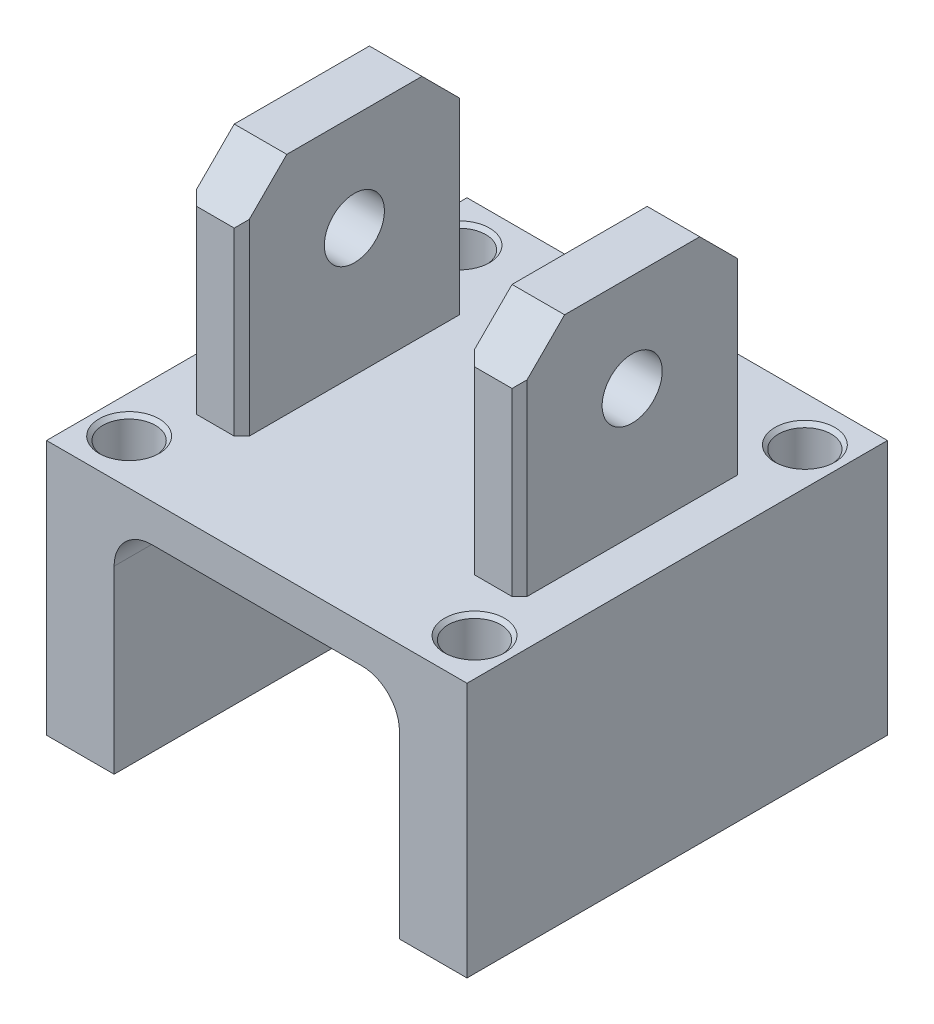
ISO-10303-21;
HEADER;
FILE_DESCRIPTION(('STEP AP214'),'2;1');
FILE_NAME('part.step','',(''),(''),'','','');
FILE_SCHEMA(('AUTOMOTIVE_DESIGN { 1 0 10303 214 1 1 1 1 }'));
ENDSEC;
DATA;
#1=APPLICATION_CONTEXT('core data for automotive mechanical design processes');
#2=APPLICATION_PROTOCOL_DEFINITION('international standard','automotive_design',2000,#1);
#3=PRODUCT_CONTEXT('',#1,'mechanical');
#4=PRODUCT('Part','Part','',(#3));
#5=PRODUCT_RELATED_PRODUCT_CATEGORY('part','',(#4));
#6=PRODUCT_DEFINITION_FORMATION('','',#4);
#7=PRODUCT_DEFINITION_CONTEXT('part definition',#1,'design');
#8=PRODUCT_DEFINITION('design','',#6,#7);
#9=PRODUCT_DEFINITION_SHAPE('','',#8);
#10=(LENGTH_UNIT() NAMED_UNIT(*) SI_UNIT(.MILLI.,.METRE.));
#11=(NAMED_UNIT(*) PLANE_ANGLE_UNIT() SI_UNIT($,.RADIAN.));
#12=(NAMED_UNIT(*) SI_UNIT($,.STERADIAN.) SOLID_ANGLE_UNIT());
#13=UNCERTAINTY_MEASURE_WITH_UNIT(LENGTH_MEASURE(1.E-05),#10,'distance_accuracy_value','');
#14=(GEOMETRIC_REPRESENTATION_CONTEXT(3) GLOBAL_UNCERTAINTY_ASSIGNED_CONTEXT((#13)) GLOBAL_UNIT_ASSIGNED_CONTEXT((#10,
#11,#12)) REPRESENTATION_CONTEXT('',''));
#15=CARTESIAN_POINT('',(0.,0.,0.));
#16=DIRECTION('',(0.,0.,1.));
#17=DIRECTION('',(1.,0.,0.));
#18=AXIS2_PLACEMENT_3D('',#15,#16,#17);
#19=CARTESIAN_POINT('',(0.,34.,0.));
#20=DIRECTION('',(0.,1.,0.));
#21=DIRECTION('',(0.,0.,1.));
#22=AXIS2_PLACEMENT_3D('',#19,#20,#21);
#23=PLANE('',#22);
#24=CARTESIAN_POINT('',(-5.74413981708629,34.,-21.0049999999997));
#25=DIRECTION('',(0.,1.,0.));
#26=DIRECTION('',(0.,0.,1.));
#27=AXIS2_PLACEMENT_3D('',#24,#25,#26);
#28=CIRCLE('',#27,3.);
#29=CARTESIAN_POINT('',(-5.74413981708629,34.,-18.0049999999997));
#30=VERTEX_POINT('',#29);
#31=EDGE_CURVE('E1315',#30,#30,#28,.T.);
#32=ORIENTED_EDGE('',*,*,#31,.F.);
#33=EDGE_LOOP('',(#32));
#34=FACE_BOUND('',#33,.T.);
#35=CARTESIAN_POINT('',(3.95586018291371,34.,-21.0049999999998));
#36=DIRECTION('',(0.,1.,0.));
#37=DIRECTION('',(0.,0.,1.));
#38=AXIS2_PLACEMENT_3D('',#35,#36,#37);
#39=CIRCLE('',#38,3.);
#40=CARTESIAN_POINT('',(3.95586018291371,34.,-18.0049999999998));
#41=VERTEX_POINT('',#40);
#42=EDGE_CURVE('E457',#41,#41,#39,.T.);
#43=ORIENTED_EDGE('',*,*,#42,.F.);
#44=EDGE_LOOP('',(#43));
#45=FACE_BOUND('',#44,.T.);
#46=CARTESIAN_POINT('',(23.,34.,-22.));
#47=DIRECTION('',(0.,1.,0.));
#48=DIRECTION('',(0.,0.,1.));
#49=AXIS2_PLACEMENT_3D('',#46,#47,#48);
#50=CIRCLE('',#49,3.99999999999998);
#51=CARTESIAN_POINT('',(23.,34.,-18.));
#52=VERTEX_POINT('',#51);
#53=EDGE_CURVE('E411',#52,#52,#50,.F.);
#54=ORIENTED_EDGE('',*,*,#53,.T.);
#55=EDGE_LOOP('',(#54));
#56=FACE_BOUND('',#55,.T.);
#57=CARTESIAN_POINT('',(-23.,34.,22.));
#58=DIRECTION('',(0.,1.,0.));
#59=DIRECTION('',(0.,0.,1.));
#60=AXIS2_PLACEMENT_3D('',#57,#58,#59);
#61=CIRCLE('',#60,3.99999999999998);
#62=CARTESIAN_POINT('',(-23.,34.,26.));
#63=VERTEX_POINT('',#62);
#64=EDGE_CURVE('E408',#63,#63,#61,.F.);
#65=ORIENTED_EDGE('',*,*,#64,.T.);
#66=EDGE_LOOP('',(#65));
#67=FACE_BOUND('',#66,.T.);
#68=CARTESIAN_POINT('',(23.,34.,22.));
#69=DIRECTION('',(0.,1.,0.));
#70=DIRECTION('',(0.,0.,1.));
#71=AXIS2_PLACEMENT_3D('',#68,#69,#70);
#72=CIRCLE('',#71,3.99999999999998);
#73=CARTESIAN_POINT('',(23.,34.,26.));
#74=VERTEX_POINT('',#73);
#75=EDGE_CURVE('E405',#74,#74,#72,.F.);
#76=ORIENTED_EDGE('',*,*,#75,.T.);
#77=EDGE_LOOP('',(#76));
#78=FACE_BOUND('',#77,.T.);
#79=CARTESIAN_POINT('',(-23.,34.,-22.));
#80=DIRECTION('',(0.,1.,0.));
#81=DIRECTION('',(0.,0.,1.));
#82=AXIS2_PLACEMENT_3D('',#79,#80,#81);
#83=CIRCLE('',#82,3.99999999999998);
#84=CARTESIAN_POINT('',(-23.,34.,-18.));
#85=VERTEX_POINT('',#84);
#86=EDGE_CURVE('E402',#85,#85,#83,.F.);
#87=ORIENTED_EDGE('',*,*,#86,.T.);
#88=EDGE_LOOP('',(#87));
#89=FACE_BOUND('',#88,.T.);
#90=DIRECTION('',(0.,0.,-1.));
#91=VECTOR('',#90,1.);
#92=CARTESIAN_POINT('',(28.,34.,-28.));
#93=LINE('',#92,#91);
#94=CARTESIAN_POINT('',(28.,34.,28.));
#95=VERTEX_POINT('',#94);
#96=CARTESIAN_POINT('',(28.,34.,-28.));
#97=VERTEX_POINT('',#96);
#98=EDGE_CURVE('E265',#95,#97,#93,.T.);
#99=ORIENTED_EDGE('',*,*,#98,.T.);
#100=DIRECTION('',(-1.,0.,0.));
#101=VECTOR('',#100,1.);
#102=CARTESIAN_POINT('',(-28.,34.,-28.));
#103=LINE('',#102,#101);
#104=CARTESIAN_POINT('',(-28.,34.,-28.));
#105=VERTEX_POINT('',#104);
#106=EDGE_CURVE('E269',#97,#105,#103,.T.);
#107=ORIENTED_EDGE('',*,*,#106,.T.);
#108=DIRECTION('',(0.,0.,1.));
#109=VECTOR('',#108,1.);
#110=CARTESIAN_POINT('',(-28.,34.,-28.));
#111=LINE('',#110,#109);
#112=CARTESIAN_POINT('',(-28.,34.,28.));
#113=VERTEX_POINT('',#112);
#114=EDGE_CURVE('E560',#105,#113,#111,.T.);
#115=ORIENTED_EDGE('',*,*,#114,.T.);
#116=DIRECTION('',(1.,0.,0.));
#117=VECTOR('',#116,1.);
#118=CARTESIAN_POINT('',(-28.,34.,28.));
#119=LINE('',#118,#117);
#120=EDGE_CURVE('E278',#113,#95,#119,.T.);
#121=ORIENTED_EDGE('',*,*,#120,.T.);
#122=EDGE_LOOP('',(#99,#107,#115,#121));
#123=FACE_BOUND('',#122,.T.);
#124=DIRECTION('',(1.,0.,0.));
#125=VECTOR('',#124,1.);
#126=CARTESIAN_POINT('',(-22.,34.,15.));
#127=LINE('',#126,#125);
#128=CARTESIAN_POINT('',(-21.,34.,15.));
#129=VERTEX_POINT('',#128);
#130=CARTESIAN_POINT('',(-16.,34.,15.));
#131=VERTEX_POINT('',#130);
#132=EDGE_CURVE('E520',#129,#131,#127,.T.);
#133=ORIENTED_EDGE('',*,*,#132,.F.);
#134=DIRECTION('',(0.707106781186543,0.,0.707106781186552));
#135=VECTOR('',#134,1.);
#136=CARTESIAN_POINT('',(-21.,34.,15.));
#137=LINE('',#136,#135);
#138=CARTESIAN_POINT('',(-22.,34.,14.));
#139=VERTEX_POINT('',#138);
#140=EDGE_CURVE('E61',#129,#139,#137,.F.);
#141=ORIENTED_EDGE('',*,*,#140,.T.);
#142=DIRECTION('',(0.,0.,1.));
#143=VECTOR('',#142,1.);
#144=CARTESIAN_POINT('',(-22.,34.,-15.));
#145=LINE('',#144,#143);
#146=CARTESIAN_POINT('',(-22.,34.,-14.));
#147=VERTEX_POINT('',#146);
#148=EDGE_CURVE('E501',#147,#139,#145,.T.);
#149=ORIENTED_EDGE('',*,*,#148,.F.);
#150=DIRECTION('',(-0.707106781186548,0.,0.707106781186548));
#151=VECTOR('',#150,1.);
#152=CARTESIAN_POINT('',(-22.,34.,-14.));
#153=LINE('',#152,#151);
#154=CARTESIAN_POINT('',(-21.,34.,-15.));
#155=VERTEX_POINT('',#154);
#156=EDGE_CURVE('E385',#147,#155,#153,.F.);
#157=ORIENTED_EDGE('',*,*,#156,.T.);
#158=DIRECTION('',(-1.,0.,0.));
#159=VECTOR('',#158,1.);
#160=CARTESIAN_POINT('',(-22.,34.,-15.));
#161=LINE('',#160,#159);
#162=CARTESIAN_POINT('',(-16.,34.,-15.));
#163=VERTEX_POINT('',#162);
#164=EDGE_CURVE('E515',#163,#155,#161,.T.);
#165=ORIENTED_EDGE('',*,*,#164,.F.);
#166=DIRECTION('',(-0.707106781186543,0.,-0.707106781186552));
#167=VECTOR('',#166,1.);
#168=CARTESIAN_POINT('',(-16.,34.,-15.));
#169=LINE('',#168,#167);
#170=CARTESIAN_POINT('',(-15.,34.,-14.));
#171=VERTEX_POINT('',#170);
#172=EDGE_CURVE('E387',#163,#171,#169,.F.);
#173=ORIENTED_EDGE('',*,*,#172,.T.);
#174=DIRECTION('',(0.,0.,-1.));
#175=VECTOR('',#174,1.);
#176=CARTESIAN_POINT('',(-15.,34.,-15.));
#177=LINE('',#176,#175);
#178=CARTESIAN_POINT('',(-15.,34.,14.));
#179=VERTEX_POINT('',#178);
#180=EDGE_CURVE('E522',#179,#171,#177,.T.);
#181=ORIENTED_EDGE('',*,*,#180,.F.);
#182=DIRECTION('',(0.707106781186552,0.,-0.707106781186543));
#183=VECTOR('',#182,1.);
#184=CARTESIAN_POINT('',(-15.,34.,14.));
#185=LINE('',#184,#183);
#186=EDGE_CURVE('E53',#179,#131,#185,.F.);
#187=ORIENTED_EDGE('',*,*,#186,.T.);
#188=EDGE_LOOP('',(#133,#141,#149,#157,#165,#173,#181,#187));
#189=FACE_BOUND('',#188,.T.);
#190=DIRECTION('',(0.,0.,1.));
#191=VECTOR('',#190,1.);
#192=CARTESIAN_POINT('',(15.,34.,-15.));
#193=LINE('',#192,#191);
#194=CARTESIAN_POINT('',(15.,34.,-14.));
#195=VERTEX_POINT('',#194);
#196=CARTESIAN_POINT('',(15.,34.,14.));
#197=VERTEX_POINT('',#196);
#198=EDGE_CURVE('E504',#195,#197,#193,.T.);
#199=ORIENTED_EDGE('',*,*,#198,.F.);
#200=DIRECTION('',(-0.707106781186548,0.,0.707106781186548));
#201=VECTOR('',#200,1.);
#202=CARTESIAN_POINT('',(15.,34.,-14.));
#203=LINE('',#202,#201);
#204=CARTESIAN_POINT('',(16.,34.,-15.));
#205=VERTEX_POINT('',#204);
#206=EDGE_CURVE('E389',#195,#205,#203,.F.);
#207=ORIENTED_EDGE('',*,*,#206,.T.);
#208=DIRECTION('',(-1.,0.,0.));
#209=VECTOR('',#208,1.);
#210=CARTESIAN_POINT('',(22.,34.,-15.));
#211=LINE('',#210,#209);
#212=CARTESIAN_POINT('',(21.,34.,-15.));
#213=VERTEX_POINT('',#212);
#214=EDGE_CURVE('E493',#213,#205,#211,.T.);
#215=ORIENTED_EDGE('',*,*,#214,.F.);
#216=DIRECTION('',(-0.707106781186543,0.,-0.707106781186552));
#217=VECTOR('',#216,1.);
#218=CARTESIAN_POINT('',(21.,34.,-15.));
#219=LINE('',#218,#217);
#220=CARTESIAN_POINT('',(22.,34.,-14.));
#221=VERTEX_POINT('',#220);
#222=EDGE_CURVE('E391',#213,#221,#219,.F.);
#223=ORIENTED_EDGE('',*,*,#222,.T.);
#224=DIRECTION('',(0.,0.,-1.));
#225=VECTOR('',#224,1.);
#226=CARTESIAN_POINT('',(22.,34.,-15.));
#227=LINE('',#226,#225);
#228=CARTESIAN_POINT('',(22.,34.,14.));
#229=VERTEX_POINT('',#228);
#230=EDGE_CURVE('E498',#229,#221,#227,.T.);
#231=ORIENTED_EDGE('',*,*,#230,.F.);
#232=DIRECTION('',(0.707106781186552,0.,-0.707106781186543));
#233=VECTOR('',#232,1.);
#234=CARTESIAN_POINT('',(22.,34.,14.));
#235=LINE('',#234,#233);
#236=CARTESIAN_POINT('',(21.,34.,15.));
#237=VERTEX_POINT('',#236);
#238=EDGE_CURVE('E393',#229,#237,#235,.F.);
#239=ORIENTED_EDGE('',*,*,#238,.T.);
#240=DIRECTION('',(1.,0.,0.));
#241=VECTOR('',#240,1.);
#242=CARTESIAN_POINT('',(22.,34.,15.));
#243=LINE('',#242,#241);
#244=CARTESIAN_POINT('',(16.,34.,15.));
#245=VERTEX_POINT('',#244);
#246=EDGE_CURVE('E507',#245,#237,#243,.T.);
#247=ORIENTED_EDGE('',*,*,#246,.F.);
#248=DIRECTION('',(0.707106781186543,0.,0.707106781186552));
#249=VECTOR('',#248,1.);
#250=CARTESIAN_POINT('',(16.,34.,15.));
#251=LINE('',#250,#249);
#252=EDGE_CURVE('E395',#245,#197,#251,.F.);
#253=ORIENTED_EDGE('',*,*,#252,.T.);
#254=EDGE_LOOP('',(#199,#207,#215,#223,#231,#239,#247,#253));
#255=FACE_BOUND('',#254,.T.);
#256=ADVANCED_FACE('F36',(#34,#45,#56,#67,#78,#89,#123,#189,#255),#23,.T.);
#257=CARTESIAN_POINT('',(0.,0.,0.));
#258=DIRECTION('',(0.,1.,0.));
#259=DIRECTION('',(0.,0.,1.));
#260=AXIS2_PLACEMENT_3D('',#257,#258,#259);
#261=PLANE('',#260);
#262=CARTESIAN_POINT('',(-23.,0.,22.));
#263=DIRECTION('',(0.,1.,0.));
#264=DIRECTION('',(0.,0.,1.));
#265=AXIS2_PLACEMENT_3D('',#262,#263,#264);
#266=CIRCLE('',#265,2.99999999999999);
#267=CARTESIAN_POINT('',(-23.,0.,25.));
#268=VERTEX_POINT('',#267);
#269=EDGE_CURVE('E420',#268,#268,#266,.T.);
#270=ORIENTED_EDGE('',*,*,#269,.T.);
#271=EDGE_LOOP('',(#270));
#272=FACE_BOUND('',#271,.T.);
#273=CARTESIAN_POINT('',(-23.,0.,-22.));
#274=DIRECTION('',(0.,1.,0.));
#275=DIRECTION('',(0.,0.,1.));
#276=AXIS2_PLACEMENT_3D('',#273,#274,#275);
#277=CIRCLE('',#276,2.99999999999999);
#278=CARTESIAN_POINT('',(-23.,0.,-19.));
#279=VERTEX_POINT('',#278);
#280=EDGE_CURVE('E417',#279,#279,#277,.T.);
#281=ORIENTED_EDGE('',*,*,#280,.T.);
#282=EDGE_LOOP('',(#281));
#283=FACE_BOUND('',#282,.T.);
#284=DIRECTION('',(-1.,0.,0.));
#285=VECTOR('',#284,1.);
#286=CARTESIAN_POINT('',(-28.,0.,-28.));
#287=LINE('',#286,#285);
#288=CARTESIAN_POINT('',(-19.,0.,-28.));
#289=VERTEX_POINT('',#288);
#290=CARTESIAN_POINT('',(-28.,0.,-28.));
#291=VERTEX_POINT('',#290);
#292=EDGE_CURVE('E256',#289,#291,#287,.T.);
#293=ORIENTED_EDGE('',*,*,#292,.F.);
#294=DIRECTION('',(0.,0.,1.));
#295=VECTOR('',#294,1.);
#296=CARTESIAN_POINT('',(-19.,0.,-28.));
#297=LINE('',#296,#295);
#298=CARTESIAN_POINT('',(-19.,0.,28.));
#299=VERTEX_POINT('',#298);
#300=EDGE_CURVE('E240',#289,#299,#297,.T.);
#301=ORIENTED_EDGE('',*,*,#300,.T.);
#302=DIRECTION('',(1.,0.,0.));
#303=VECTOR('',#302,1.);
#304=CARTESIAN_POINT('',(-28.,0.,28.));
#305=LINE('',#304,#303);
#306=CARTESIAN_POINT('',(-28.,0.,28.));
#307=VERTEX_POINT('',#306);
#308=EDGE_CURVE('E255',#307,#299,#305,.T.);
#309=ORIENTED_EDGE('',*,*,#308,.F.);
#310=DIRECTION('',(0.,0.,1.));
#311=VECTOR('',#310,1.);
#312=CARTESIAN_POINT('',(-28.,0.,-28.));
#313=LINE('',#312,#311);
#314=EDGE_CURVE('E271',#291,#307,#313,.T.);
#315=ORIENTED_EDGE('',*,*,#314,.F.);
#316=EDGE_LOOP('',(#293,#301,#309,#315));
#317=FACE_BOUND('',#316,.T.);
#318=ADVANCED_FACE('F253',(#272,#283,#317),#261,.F.);
#319=CARTESIAN_POINT('',(28.,34.,-28.));
#320=DIRECTION('',(-1.,0.,0.));
#321=DIRECTION('',(0.,0.,1.));
#322=AXIS2_PLACEMENT_3D('',#319,#320,#321);
#323=PLANE('',#322);
#324=DIRECTION('',(0.,0.,-1.));
#325=VECTOR('',#324,1.);
#326=CARTESIAN_POINT('',(28.,0.,-28.));
#327=LINE('',#326,#325);
#328=CARTESIAN_POINT('',(28.,0.,28.));
#329=VERTEX_POINT('',#328);
#330=CARTESIAN_POINT('',(28.,0.,-28.));
#331=VERTEX_POINT('',#330);
#332=EDGE_CURVE('E551',#329,#331,#327,.T.);
#333=ORIENTED_EDGE('',*,*,#332,.T.);
#334=DIRECTION('',(0.,-1.,0.));
#335=VECTOR('',#334,1.);
#336=CARTESIAN_POINT('',(28.,34.,-28.));
#337=LINE('',#336,#335);
#338=EDGE_CURVE('E283',#97,#331,#337,.T.);
#339=ORIENTED_EDGE('',*,*,#338,.F.);
#340=ORIENTED_EDGE('',*,*,#98,.F.);
#341=DIRECTION('',(0.,-1.,0.));
#342=VECTOR('',#341,1.);
#343=CARTESIAN_POINT('',(28.,34.,28.));
#344=LINE('',#343,#342);
#345=EDGE_CURVE('E275',#95,#329,#344,.T.);
#346=ORIENTED_EDGE('',*,*,#345,.T.);
#347=EDGE_LOOP('',(#333,#339,#340,#346));
#348=FACE_BOUND('',#347,.T.);
#349=ADVANCED_FACE('F578',(#348),#323,.F.);
#350=CARTESIAN_POINT('',(-28.,34.,-28.));
#351=DIRECTION('',(0.,0.,1.));
#352=DIRECTION('',(1.,0.,0.));
#353=AXIS2_PLACEMENT_3D('',#350,#351,#352);
#354=PLANE('',#353);
#355=CARTESIAN_POINT('',(-14.,24.,-28.));
#356=DIRECTION('',(0.,0.,1.));
#357=DIRECTION('',(-1.,0.,0.));
#358=AXIS2_PLACEMENT_3D('',#355,#356,#357);
#359=CIRCLE('',#358,5.);
#360=CARTESIAN_POINT('',(-14.,29.,-28.));
#361=VERTEX_POINT('',#360);
#362=CARTESIAN_POINT('',(-19.,24.,-28.));
#363=VERTEX_POINT('',#362);
#364=EDGE_CURVE('E258',#361,#363,#359,.T.);
#365=ORIENTED_EDGE('',*,*,#364,.T.);
#366=DIRECTION('',(0.,-1.,0.));
#367=VECTOR('',#366,1.);
#368=CARTESIAN_POINT('',(-19.,0.,-28.));
#369=LINE('',#368,#367);
#370=EDGE_CURVE('E537',#363,#289,#369,.T.);
#371=ORIENTED_EDGE('',*,*,#370,.T.);
#372=ORIENTED_EDGE('',*,*,#292,.T.);
#373=DIRECTION('',(0.,-1.,0.));
#374=VECTOR('',#373,1.);
#375=CARTESIAN_POINT('',(-28.,34.,-28.));
#376=LINE('',#375,#374);
#377=EDGE_CURVE('E280',#105,#291,#376,.T.);
#378=ORIENTED_EDGE('',*,*,#377,.F.);
#379=ORIENTED_EDGE('',*,*,#106,.F.);
#380=ORIENTED_EDGE('',*,*,#338,.T.);
#381=CARTESIAN_POINT('',(19.,0.,-28.));
#382=VERTEX_POINT('',#381);
#383=EDGE_CURVE('E564',#331,#382,#287,.T.);
#384=ORIENTED_EDGE('',*,*,#383,.T.);
#385=DIRECTION('',(0.,1.,0.));
#386=VECTOR('',#385,1.);
#387=CARTESIAN_POINT('',(19.,0.,-28.));
#388=LINE('',#387,#386);
#389=CARTESIAN_POINT('',(19.,24.,-28.));
#390=VERTEX_POINT('',#389);
#391=EDGE_CURVE('E539',#382,#390,#388,.T.);
#392=ORIENTED_EDGE('',*,*,#391,.T.);
#393=CARTESIAN_POINT('',(14.,24.,-28.));
#394=DIRECTION('',(0.,0.,1.));
#395=DIRECTION('',(1.,0.,0.));
#396=AXIS2_PLACEMENT_3D('',#393,#394,#395);
#397=CIRCLE('',#396,5.);
#398=CARTESIAN_POINT('',(14.,29.,-28.));
#399=VERTEX_POINT('',#398);
#400=EDGE_CURVE('E542',#390,#399,#397,.T.);
#401=ORIENTED_EDGE('',*,*,#400,.T.);
#402=DIRECTION('',(-1.,0.,0.));
#403=VECTOR('',#402,1.);
#404=CARTESIAN_POINT('',(-14.,29.,-28.));
#405=LINE('',#404,#403);
#406=EDGE_CURVE('E545',#399,#361,#405,.T.);
#407=ORIENTED_EDGE('',*,*,#406,.T.);
#408=EDGE_LOOP('',(#365,#371,#372,#378,#379,#380,#384,#392,#401,#407));
#409=FACE_BOUND('',#408,.T.);
#410=ADVANCED_FACE('F568',(#409),#354,.F.);
#411=CARTESIAN_POINT('',(-28.,34.,-28.));
#412=DIRECTION('',(1.,0.,0.));
#413=DIRECTION('',(0.,0.,-1.));
#414=AXIS2_PLACEMENT_3D('',#411,#412,#413);
#415=PLANE('',#414);
#416=ORIENTED_EDGE('',*,*,#314,.T.);
#417=DIRECTION('',(0.,-1.,0.));
#418=VECTOR('',#417,1.);
#419=CARTESIAN_POINT('',(-28.,34.,28.));
#420=LINE('',#419,#418);
#421=EDGE_CURVE('E264',#113,#307,#420,.T.);
#422=ORIENTED_EDGE('',*,*,#421,.F.);
#423=ORIENTED_EDGE('',*,*,#114,.F.);
#424=ORIENTED_EDGE('',*,*,#377,.T.);
#425=EDGE_LOOP('',(#416,#422,#423,#424));
#426=FACE_BOUND('',#425,.T.);
#427=ADVANCED_FACE('F571',(#426),#415,.F.);
#428=CARTESIAN_POINT('',(-28.,34.,28.));
#429=DIRECTION('',(0.,0.,-1.));
#430=DIRECTION('',(-1.,0.,0.));
#431=AXIS2_PLACEMENT_3D('',#428,#429,#430);
#432=PLANE('',#431);
#433=ORIENTED_EDGE('',*,*,#308,.T.);
#434=DIRECTION('',(0.,-1.,0.));
#435=VECTOR('',#434,1.);
#436=CARTESIAN_POINT('',(-19.,0.,28.));
#437=LINE('',#436,#435);
#438=CARTESIAN_POINT('',(-19.,24.,28.));
#439=VERTEX_POINT('',#438);
#440=EDGE_CURVE('E236',#439,#299,#437,.T.);
#441=ORIENTED_EDGE('',*,*,#440,.F.);
#442=CARTESIAN_POINT('',(-14.,24.,28.));
#443=DIRECTION('',(0.,0.,1.));
#444=DIRECTION('',(-1.,0.,0.));
#445=AXIS2_PLACEMENT_3D('',#442,#443,#444);
#446=CIRCLE('',#445,5.);
#447=CARTESIAN_POINT('',(-14.,29.,28.));
#448=VERTEX_POINT('',#447);
#449=EDGE_CURVE('E535',#448,#439,#446,.T.);
#450=ORIENTED_EDGE('',*,*,#449,.F.);
#451=DIRECTION('',(-1.,0.,0.));
#452=VECTOR('',#451,1.);
#453=CARTESIAN_POINT('',(-14.,29.,28.));
#454=LINE('',#453,#452);
#455=CARTESIAN_POINT('',(14.,29.,28.));
#456=VERTEX_POINT('',#455);
#457=EDGE_CURVE('E532',#456,#448,#454,.T.);
#458=ORIENTED_EDGE('',*,*,#457,.F.);
#459=CARTESIAN_POINT('',(14.,24.,28.));
#460=DIRECTION('',(0.,0.,1.));
#461=DIRECTION('',(1.,0.,0.));
#462=AXIS2_PLACEMENT_3D('',#459,#460,#461);
#463=CIRCLE('',#462,5.);
#464=CARTESIAN_POINT('',(19.,24.,28.));
#465=VERTEX_POINT('',#464);
#466=EDGE_CURVE('E529',#465,#456,#463,.T.);
#467=ORIENTED_EDGE('',*,*,#466,.F.);
#468=DIRECTION('',(0.,1.,0.));
#469=VECTOR('',#468,1.);
#470=CARTESIAN_POINT('',(19.,0.,28.));
#471=LINE('',#470,#469);
#472=CARTESIAN_POINT('',(19.,0.,28.));
#473=VERTEX_POINT('',#472);
#474=EDGE_CURVE('E247',#473,#465,#471,.T.);
#475=ORIENTED_EDGE('',*,*,#474,.F.);
#476=EDGE_CURVE('E266',#473,#329,#305,.T.);
#477=ORIENTED_EDGE('',*,*,#476,.T.);
#478=ORIENTED_EDGE('',*,*,#345,.F.);
#479=ORIENTED_EDGE('',*,*,#120,.F.);
#480=ORIENTED_EDGE('',*,*,#421,.T.);
#481=EDGE_LOOP('',(#433,#441,#450,#458,#467,#475,#477,#478,#479,#480));
#482=FACE_BOUND('',#481,.T.);
#483=ADVANCED_FACE('F261',(#482),#432,.F.);
#484=CARTESIAN_POINT('',(23.,0.,22.));
#485=DIRECTION('',(0.,1.,0.));
#486=DIRECTION('',(0.,0.,1.));
#487=AXIS2_PLACEMENT_3D('',#484,#485,#486);
#488=CIRCLE('',#487,2.99999999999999);
#489=CARTESIAN_POINT('',(23.,0.,25.));
#490=VERTEX_POINT('',#489);
#491=EDGE_CURVE('E429',#490,#490,#488,.T.);
#492=ORIENTED_EDGE('',*,*,#491,.T.);
#493=EDGE_LOOP('',(#492));
#494=FACE_BOUND('',#493,.T.);
#495=CARTESIAN_POINT('',(23.,0.,-22.));
#496=DIRECTION('',(0.,1.,0.));
#497=DIRECTION('',(0.,0.,1.));
#498=AXIS2_PLACEMENT_3D('',#495,#496,#497);
#499=CIRCLE('',#498,2.99999999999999);
#500=CARTESIAN_POINT('',(23.,0.,-19.));
#501=VERTEX_POINT('',#500);
#502=EDGE_CURVE('E426',#501,#501,#499,.T.);
#503=ORIENTED_EDGE('',*,*,#502,.T.);
#504=EDGE_LOOP('',(#503));
#505=FACE_BOUND('',#504,.T.);
#506=ORIENTED_EDGE('',*,*,#476,.F.);
#507=DIRECTION('',(0.,0.,1.));
#508=VECTOR('',#507,1.);
#509=CARTESIAN_POINT('',(19.,0.,-28.));
#510=LINE('',#509,#508);
#511=EDGE_CURVE('E257',#382,#473,#510,.T.);
#512=ORIENTED_EDGE('',*,*,#511,.F.);
#513=ORIENTED_EDGE('',*,*,#383,.F.);
#514=ORIENTED_EDGE('',*,*,#332,.F.);
#515=EDGE_LOOP('',(#506,#512,#513,#514));
#516=FACE_BOUND('',#515,.T.);
#517=ADVANCED_FACE('F581',(#494,#505,#516),#261,.F.);
#518=CARTESIAN_POINT('',(-19.,0.,-28.));
#519=DIRECTION('',(-1.,0.,0.));
#520=DIRECTION('',(0.,0.,1.));
#521=AXIS2_PLACEMENT_3D('',#518,#519,#520);
#522=PLANE('',#521);
#523=ORIENTED_EDGE('',*,*,#300,.F.);
#524=ORIENTED_EDGE('',*,*,#370,.F.);
#525=DIRECTION('',(0.,0.,1.));
#526=VECTOR('',#525,1.);
#527=CARTESIAN_POINT('',(-19.,24.,-28.));
#528=LINE('',#527,#526);
#529=EDGE_CURVE('E242',#363,#439,#528,.T.);
#530=ORIENTED_EDGE('',*,*,#529,.T.);
#531=ORIENTED_EDGE('',*,*,#440,.T.);
#532=EDGE_LOOP('',(#523,#524,#530,#531));
#533=FACE_BOUND('',#532,.T.);
#534=ADVANCED_FACE('F238',(#533),#522,.F.);
#535=CARTESIAN_POINT('',(-14.,24.,-28.));
#536=DIRECTION('',(0.,0.,1.));
#537=DIRECTION('',(1.,0.,0.));
#538=AXIS2_PLACEMENT_3D('',#535,#536,#537);
#539=CYLINDRICAL_SURFACE('',#538,5.);
#540=ORIENTED_EDGE('',*,*,#529,.F.);
#541=ORIENTED_EDGE('',*,*,#364,.F.);
#542=DIRECTION('',(0.,0.,1.));
#543=VECTOR('',#542,1.);
#544=CARTESIAN_POINT('',(-14.,29.,-28.));
#545=LINE('',#544,#543);
#546=EDGE_CURVE('E552',#361,#448,#545,.T.);
#547=ORIENTED_EDGE('',*,*,#546,.T.);
#548=ORIENTED_EDGE('',*,*,#449,.T.);
#549=EDGE_LOOP('',(#540,#541,#547,#548));
#550=FACE_BOUND('',#549,.T.);
#551=ADVANCED_FACE('F596',(#550),#539,.F.);
#552=CARTESIAN_POINT('',(-14.,29.,-28.));
#553=DIRECTION('',(0.,1.,0.));
#554=DIRECTION('',(0.,0.,1.));
#555=AXIS2_PLACEMENT_3D('',#552,#553,#554);
#556=PLANE('',#555);
#557=CARTESIAN_POINT('',(-5.74413981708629,29.,-21.0049999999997));
#558=DIRECTION('',(0.,1.,0.));
#559=DIRECTION('',(0.,0.,1.));
#560=AXIS2_PLACEMENT_3D('',#557,#558,#559);
#561=CIRCLE('',#560,1.59999999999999);
#562=CARTESIAN_POINT('',(-5.74413981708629,29.,-19.4049999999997));
#563=VERTEX_POINT('',#562);
#564=EDGE_CURVE('E40',#563,#563,#561,.T.);
#565=ORIENTED_EDGE('',*,*,#564,.T.);
#566=EDGE_LOOP('',(#565));
#567=FACE_BOUND('',#566,.T.);
#568=CARTESIAN_POINT('',(3.95586018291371,29.,-21.0049999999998));
#569=DIRECTION('',(0.,1.,0.));
#570=DIRECTION('',(0.,0.,1.));
#571=AXIS2_PLACEMENT_3D('',#568,#569,#570);
#572=CIRCLE('',#571,1.59999999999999);
#573=CARTESIAN_POINT('',(3.95586018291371,29.,-19.4049999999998));
#574=VERTEX_POINT('',#573);
#575=EDGE_CURVE('E442',#574,#574,#572,.T.);
#576=ORIENTED_EDGE('',*,*,#575,.T.);
#577=EDGE_LOOP('',(#576));
#578=FACE_BOUND('',#577,.T.);
#579=ORIENTED_EDGE('',*,*,#546,.F.);
#580=ORIENTED_EDGE('',*,*,#406,.F.);
#581=DIRECTION('',(0.,0.,1.));
#582=VECTOR('',#581,1.);
#583=CARTESIAN_POINT('',(14.,29.,-28.));
#584=LINE('',#583,#582);
#585=EDGE_CURVE('E554',#399,#456,#584,.T.);
#586=ORIENTED_EDGE('',*,*,#585,.T.);
#587=ORIENTED_EDGE('',*,*,#457,.T.);
#588=EDGE_LOOP('',(#579,#580,#586,#587));
#589=FACE_BOUND('',#588,.T.);
#590=ADVANCED_FACE('F594',(#567,#578,#589),#556,.F.);
#591=CARTESIAN_POINT('',(14.,24.,-28.));
#592=DIRECTION('',(0.,0.,1.));
#593=DIRECTION('',(1.,0.,0.));
#594=AXIS2_PLACEMENT_3D('',#591,#592,#593);
#595=CYLINDRICAL_SURFACE('',#594,5.);
#596=ORIENTED_EDGE('',*,*,#585,.F.);
#597=ORIENTED_EDGE('',*,*,#400,.F.);
#598=DIRECTION('',(0.,0.,1.));
#599=VECTOR('',#598,1.);
#600=CARTESIAN_POINT('',(19.,24.,-28.));
#601=LINE('',#600,#599);
#602=EDGE_CURVE('E556',#390,#465,#601,.T.);
#603=ORIENTED_EDGE('',*,*,#602,.T.);
#604=ORIENTED_EDGE('',*,*,#466,.T.);
#605=EDGE_LOOP('',(#596,#597,#603,#604));
#606=FACE_BOUND('',#605,.T.);
#607=ADVANCED_FACE('F589',(#606),#595,.F.);
#608=CARTESIAN_POINT('',(19.,0.,-28.));
#609=DIRECTION('',(1.,0.,0.));
#610=DIRECTION('',(0.,1.,0.));
#611=AXIS2_PLACEMENT_3D('',#608,#609,#610);
#612=PLANE('',#611);
#613=ORIENTED_EDGE('',*,*,#602,.F.);
#614=ORIENTED_EDGE('',*,*,#391,.F.);
#615=ORIENTED_EDGE('',*,*,#511,.T.);
#616=ORIENTED_EDGE('',*,*,#474,.T.);
#617=EDGE_LOOP('',(#613,#614,#615,#616));
#618=FACE_BOUND('',#617,.T.);
#619=ADVANCED_FACE('F585',(#618),#612,.F.);
#620=CARTESIAN_POINT('',(-22.,64.,-15.));
#621=DIRECTION('',(1.,0.,0.));
#622=DIRECTION('',(0.,0.,-1.));
#623=AXIS2_PLACEMENT_3D('',#620,#621,#622);
#624=PLANE('',#623);
#625=CARTESIAN_POINT('',(-22.,51.,0.));
#626=DIRECTION('',(1.,0.,0.));
#627=DIRECTION('',(0.,0.,-1.));
#628=AXIS2_PLACEMENT_3D('',#625,#626,#627);
#629=CIRCLE('',#628,4.);
#630=CARTESIAN_POINT('',(-22.,51.,-4.));
#631=VERTEX_POINT('',#630);
#632=EDGE_CURVE('E484',#631,#631,#629,.F.);
#633=ORIENTED_EDGE('',*,*,#632,.F.);
#634=EDGE_LOOP('',(#633));
#635=FACE_BOUND('',#634,.T.);
#636=DIRECTION('',(0.,-0.707106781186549,-0.707106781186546));
#637=VECTOR('',#636,1.);
#638=CARTESIAN_POINT('',(-22.,64.,-9.00000000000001));
#639=LINE('',#638,#637);
#640=CARTESIAN_POINT('',(-22.,64.,-9.00000000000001));
#641=VERTEX_POINT('',#640);
#642=CARTESIAN_POINT('',(-22.,59.,-14.));
#643=VERTEX_POINT('',#642);
#644=EDGE_CURVE('E316',#641,#643,#639,.T.);
#645=ORIENTED_EDGE('',*,*,#644,.T.);
#646=DIRECTION('',(0.,-1.,0.));
#647=VECTOR('',#646,1.);
#648=CARTESIAN_POINT('',(-22.,64.,-14.));
#649=LINE('',#648,#647);
#650=EDGE_CURVE('E332',#643,#147,#649,.T.);
#651=ORIENTED_EDGE('',*,*,#650,.T.);
#652=ORIENTED_EDGE('',*,*,#148,.T.);
#653=DIRECTION('',(0.,1.,0.));
#654=VECTOR('',#653,1.);
#655=CARTESIAN_POINT('',(-22.,64.,14.));
#656=LINE('',#655,#654);
#657=CARTESIAN_POINT('',(-22.,59.,14.));
#658=VERTEX_POINT('',#657);
#659=EDGE_CURVE('E330',#139,#658,#656,.T.);
#660=ORIENTED_EDGE('',*,*,#659,.T.);
#661=DIRECTION('',(0.,0.707106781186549,-0.707106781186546));
#662=VECTOR('',#661,1.);
#663=CARTESIAN_POINT('',(-22.,64.,9.));
#664=LINE('',#663,#662);
#665=CARTESIAN_POINT('',(-22.,64.,9.));
#666=VERTEX_POINT('',#665);
#667=EDGE_CURVE('E314',#658,#666,#664,.T.);
#668=ORIENTED_EDGE('',*,*,#667,.T.);
#669=DIRECTION('',(0.,0.,1.));
#670=VECTOR('',#669,1.);
#671=CARTESIAN_POINT('',(-22.,64.,-15.));
#672=LINE('',#671,#670);
#673=EDGE_CURVE('E512',#641,#666,#672,.T.);
#674=ORIENTED_EDGE('',*,*,#673,.F.);
#675=EDGE_LOOP('',(#645,#651,#652,#660,#668,#674));
#676=FACE_BOUND('',#675,.T.);
#677=ADVANCED_FACE('F821',(#635,#676),#624,.F.);
#678=CARTESIAN_POINT('',(-22.,64.,15.));
#679=DIRECTION('',(0.,0.,-1.));
#680=DIRECTION('',(-1.,0.,0.));
#681=AXIS2_PLACEMENT_3D('',#678,#679,#680);
#682=PLANE('',#681);
#683=ORIENTED_EDGE('',*,*,#132,.T.);
#684=DIRECTION('',(0.,1.,0.));
#685=VECTOR('',#684,1.);
#686=CARTESIAN_POINT('',(-16.,64.,15.));
#687=LINE('',#686,#685);
#688=CARTESIAN_POINT('',(-16.,58.,15.));
#689=VERTEX_POINT('',#688);
#690=EDGE_CURVE('E379',#131,#689,#687,.T.);
#691=ORIENTED_EDGE('',*,*,#690,.T.);
#692=DIRECTION('',(-1.,0.,0.));
#693=VECTOR('',#692,1.);
#694=CARTESIAN_POINT('',(-22.,58.,15.));
#695=LINE('',#694,#693);
#696=CARTESIAN_POINT('',(-21.,58.,15.));
#697=VERTEX_POINT('',#696);
#698=EDGE_CURVE('E327',#689,#697,#695,.T.);
#699=ORIENTED_EDGE('',*,*,#698,.T.);
#700=DIRECTION('',(0.,-1.,0.));
#701=VECTOR('',#700,1.);
#702=CARTESIAN_POINT('',(-21.,64.,15.));
#703=LINE('',#702,#701);
#704=EDGE_CURVE('E377',#697,#129,#703,.T.);
#705=ORIENTED_EDGE('',*,*,#704,.T.);
#706=EDGE_LOOP('',(#683,#691,#699,#705));
#707=FACE_BOUND('',#706,.T.);
#708=ADVANCED_FACE('F818',(#707),#682,.F.);
#709=CARTESIAN_POINT('',(-15.,64.,-15.));
#710=DIRECTION('',(-1.,0.,0.));
#711=DIRECTION('',(0.,0.,1.));
#712=AXIS2_PLACEMENT_3D('',#709,#710,#711);
#713=PLANE('',#712);
#714=CARTESIAN_POINT('',(-15.,51.,0.));
#715=DIRECTION('',(-1.,0.,0.));
#716=DIRECTION('',(0.,0.,1.));
#717=AXIS2_PLACEMENT_3D('',#714,#715,#716);
#718=CIRCLE('',#717,4.);
#719=CARTESIAN_POINT('',(-15.,51.,4.));
#720=VERTEX_POINT('',#719);
#721=EDGE_CURVE('E490',#720,#720,#718,.T.);
#722=ORIENTED_EDGE('',*,*,#721,.T.);
#723=EDGE_LOOP('',(#722));
#724=FACE_BOUND('',#723,.T.);
#725=ORIENTED_EDGE('',*,*,#180,.T.);
#726=DIRECTION('',(0.,1.,0.));
#727=VECTOR('',#726,1.);
#728=CARTESIAN_POINT('',(-15.,64.,-14.));
#729=LINE('',#728,#727);
#730=CARTESIAN_POINT('',(-15.,59.,-14.));
#731=VERTEX_POINT('',#730);
#732=EDGE_CURVE('E347',#171,#731,#729,.T.);
#733=ORIENTED_EDGE('',*,*,#732,.T.);
#734=DIRECTION('',(0.,0.707106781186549,0.707106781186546));
#735=VECTOR('',#734,1.);
#736=CARTESIAN_POINT('',(-15.,64.,-9.00000000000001));
#737=LINE('',#736,#735);
#738=CARTESIAN_POINT('',(-15.,64.,-9.00000000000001));
#739=VERTEX_POINT('',#738);
#740=EDGE_CURVE('E325',#731,#739,#737,.T.);
#741=ORIENTED_EDGE('',*,*,#740,.T.);
#742=DIRECTION('',(0.,0.,-1.));
#743=VECTOR('',#742,1.);
#744=CARTESIAN_POINT('',(-15.,64.,-15.));
#745=LINE('',#744,#743);
#746=CARTESIAN_POINT('',(-15.,64.,9.));
#747=VERTEX_POINT('',#746);
#748=EDGE_CURVE('E248',#747,#739,#745,.T.);
#749=ORIENTED_EDGE('',*,*,#748,.F.);
#750=DIRECTION('',(0.,-0.707106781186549,0.707106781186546));
#751=VECTOR('',#750,1.);
#752=CARTESIAN_POINT('',(-15.,64.,9.));
#753=LINE('',#752,#751);
#754=CARTESIAN_POINT('',(-15.,59.,14.));
#755=VERTEX_POINT('',#754);
#756=EDGE_CURVE('E322',#747,#755,#753,.T.);
#757=ORIENTED_EDGE('',*,*,#756,.T.);
#758=DIRECTION('',(0.,-1.,0.));
#759=VECTOR('',#758,1.);
#760=CARTESIAN_POINT('',(-15.,64.,14.));
#761=LINE('',#760,#759);
#762=EDGE_CURVE('E344',#755,#179,#761,.T.);
#763=ORIENTED_EDGE('',*,*,#762,.T.);
#764=EDGE_LOOP('',(#725,#733,#741,#749,#757,#763));
#765=FACE_BOUND('',#764,.T.);
#766=ADVANCED_FACE('F814',(#724,#765),#713,.F.);
#767=CARTESIAN_POINT('',(-22.,64.,-15.));
#768=DIRECTION('',(0.,0.,1.));
#769=DIRECTION('',(1.,0.,0.));
#770=AXIS2_PLACEMENT_3D('',#767,#768,#769);
#771=PLANE('',#770);
#772=ORIENTED_EDGE('',*,*,#164,.T.);
#773=DIRECTION('',(0.,1.,0.));
#774=VECTOR('',#773,1.);
#775=CARTESIAN_POINT('',(-21.,64.,-15.));
#776=LINE('',#775,#774);
#777=CARTESIAN_POINT('',(-21.,58.,-15.));
#778=VERTEX_POINT('',#777);
#779=EDGE_CURVE('E338',#155,#778,#776,.T.);
#780=ORIENTED_EDGE('',*,*,#779,.T.);
#781=DIRECTION('',(1.,0.,0.));
#782=VECTOR('',#781,1.);
#783=CARTESIAN_POINT('',(-15.,58.,-15.));
#784=LINE('',#783,#782);
#785=CARTESIAN_POINT('',(-16.,58.,-15.));
#786=VERTEX_POINT('',#785);
#787=EDGE_CURVE('E319',#778,#786,#784,.T.);
#788=ORIENTED_EDGE('',*,*,#787,.T.);
#789=DIRECTION('',(0.,-1.,0.));
#790=VECTOR('',#789,1.);
#791=CARTESIAN_POINT('',(-16.,64.,-15.));
#792=LINE('',#791,#790);
#793=EDGE_CURVE('E335',#786,#163,#792,.T.);
#794=ORIENTED_EDGE('',*,*,#793,.T.);
#795=EDGE_LOOP('',(#772,#780,#788,#794));
#796=FACE_BOUND('',#795,.T.);
#797=ADVANCED_FACE('F810',(#796),#771,.F.);
#798=CARTESIAN_POINT('',(0.,64.,0.));
#799=DIRECTION('',(0.,1.,0.));
#800=DIRECTION('',(0.,0.,1.));
#801=AXIS2_PLACEMENT_3D('',#798,#799,#800);
#802=PLANE('',#801);
#803=ORIENTED_EDGE('',*,*,#748,.T.);
#804=DIRECTION('',(-1.,0.,0.));
#805=VECTOR('',#804,1.);
#806=CARTESIAN_POINT('',(-22.,64.,-9.00000000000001));
#807=LINE('',#806,#805);
#808=EDGE_CURVE('E311',#739,#641,#807,.T.);
#809=ORIENTED_EDGE('',*,*,#808,.T.);
#810=ORIENTED_EDGE('',*,*,#673,.T.);
#811=DIRECTION('',(1.,0.,0.));
#812=VECTOR('',#811,1.);
#813=CARTESIAN_POINT('',(-15.,64.,9.));
#814=LINE('',#813,#812);
#815=EDGE_CURVE('E308',#666,#747,#814,.T.);
#816=ORIENTED_EDGE('',*,*,#815,.T.);
#817=EDGE_LOOP('',(#803,#809,#810,#816));
#818=FACE_BOUND('',#817,.T.);
#819=ADVANCED_FACE('F806',(#818),#802,.T.);
#820=CARTESIAN_POINT('',(22.,64.,-15.));
#821=DIRECTION('',(0.,0.,1.));
#822=DIRECTION('',(1.,0.,0.));
#823=AXIS2_PLACEMENT_3D('',#820,#821,#822);
#824=PLANE('',#823);
#825=ORIENTED_EDGE('',*,*,#214,.T.);
#826=DIRECTION('',(0.,1.,0.));
#827=VECTOR('',#826,1.);
#828=CARTESIAN_POINT('',(16.,64.,-15.));
#829=LINE('',#828,#827);
#830=CARTESIAN_POINT('',(16.,58.,-15.));
#831=VERTEX_POINT('',#830);
#832=EDGE_CURVE('E357',#205,#831,#829,.T.);
#833=ORIENTED_EDGE('',*,*,#832,.T.);
#834=DIRECTION('',(1.,0.,0.));
#835=VECTOR('',#834,1.);
#836=CARTESIAN_POINT('',(22.,58.,-15.));
#837=LINE('',#836,#835);
#838=CARTESIAN_POINT('',(21.,58.,-15.));
#839=VERTEX_POINT('',#838);
#840=EDGE_CURVE('E297',#831,#839,#837,.T.);
#841=ORIENTED_EDGE('',*,*,#840,.T.);
#842=DIRECTION('',(0.,-1.,0.));
#843=VECTOR('',#842,1.);
#844=CARTESIAN_POINT('',(21.,64.,-15.));
#845=LINE('',#844,#843);
#846=EDGE_CURVE('E354',#839,#213,#845,.T.);
#847=ORIENTED_EDGE('',*,*,#846,.T.);
#848=EDGE_LOOP('',(#825,#833,#841,#847));
#849=FACE_BOUND('',#848,.T.);
#850=ADVANCED_FACE('F802',(#849),#824,.F.);
#851=CARTESIAN_POINT('',(15.,64.,-15.));
#852=DIRECTION('',(1.,0.,0.));
#853=DIRECTION('',(0.,0.,-1.));
#854=AXIS2_PLACEMENT_3D('',#851,#852,#853);
#855=PLANE('',#854);
#856=CARTESIAN_POINT('',(15.,51.,0.));
#857=DIRECTION('',(1.,0.,0.));
#858=DIRECTION('',(0.,0.,-1.));
#859=AXIS2_PLACEMENT_3D('',#856,#857,#858);
#860=CIRCLE('',#859,4.);
#861=CARTESIAN_POINT('',(15.,51.,-4.));
#862=VERTEX_POINT('',#861);
#863=EDGE_CURVE('E487',#862,#862,#860,.T.);
#864=ORIENTED_EDGE('',*,*,#863,.T.);
#865=EDGE_LOOP('',(#864));
#866=FACE_BOUND('',#865,.T.);
#867=DIRECTION('',(0.,-0.707106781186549,-0.707106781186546));
#868=VECTOR('',#867,1.);
#869=CARTESIAN_POINT('',(15.,64.,-9.00000000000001));
#870=LINE('',#869,#868);
#871=CARTESIAN_POINT('',(15.,64.,-9.00000000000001));
#872=VERTEX_POINT('',#871);
#873=CARTESIAN_POINT('',(15.,59.,-14.));
#874=VERTEX_POINT('',#873);
#875=EDGE_CURVE('E294',#872,#874,#870,.T.);
#876=ORIENTED_EDGE('',*,*,#875,.T.);
#877=DIRECTION('',(0.,-1.,0.));
#878=VECTOR('',#877,1.);
#879=CARTESIAN_POINT('',(15.,64.,-14.));
#880=LINE('',#879,#878);
#881=EDGE_CURVE('E351',#874,#195,#880,.T.);
#882=ORIENTED_EDGE('',*,*,#881,.T.);
#883=ORIENTED_EDGE('',*,*,#198,.T.);
#884=DIRECTION('',(0.,1.,0.));
#885=VECTOR('',#884,1.);
#886=CARTESIAN_POINT('',(15.,64.,14.));
#887=LINE('',#886,#885);
#888=CARTESIAN_POINT('',(15.,59.,14.));
#889=VERTEX_POINT('',#888);
#890=EDGE_CURVE('E349',#197,#889,#887,.T.);
#891=ORIENTED_EDGE('',*,*,#890,.T.);
#892=DIRECTION('',(0.,0.707106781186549,-0.707106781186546));
#893=VECTOR('',#892,1.);
#894=CARTESIAN_POINT('',(15.,64.,9.));
#895=LINE('',#894,#893);
#896=CARTESIAN_POINT('',(15.,64.,9.));
#897=VERTEX_POINT('',#896);
#898=EDGE_CURVE('E292',#889,#897,#895,.T.);
#899=ORIENTED_EDGE('',*,*,#898,.T.);
#900=DIRECTION('',(0.,0.,1.));
#901=VECTOR('',#900,1.);
#902=CARTESIAN_POINT('',(15.,64.,-15.));
#903=LINE('',#902,#901);
#904=EDGE_CURVE('E494',#872,#897,#903,.T.);
#905=ORIENTED_EDGE('',*,*,#904,.F.);
#906=EDGE_LOOP('',(#876,#882,#883,#891,#899,#905));
#907=FACE_BOUND('',#906,.T.);
#908=ADVANCED_FACE('F798',(#866,#907),#855,.F.);
#909=CARTESIAN_POINT('',(22.,64.,15.));
#910=DIRECTION('',(0.,0.,-1.));
#911=DIRECTION('',(-1.,0.,0.));
#912=AXIS2_PLACEMENT_3D('',#909,#910,#911);
#913=PLANE('',#912);
#914=ORIENTED_EDGE('',*,*,#246,.T.);
#915=DIRECTION('',(0.,1.,0.));
#916=VECTOR('',#915,1.);
#917=CARTESIAN_POINT('',(21.,64.,15.));
#918=LINE('',#917,#916);
#919=CARTESIAN_POINT('',(21.,58.,15.));
#920=VERTEX_POINT('',#919);
#921=EDGE_CURVE('E371',#237,#920,#918,.T.);
#922=ORIENTED_EDGE('',*,*,#921,.T.);
#923=DIRECTION('',(-1.,0.,0.));
#924=VECTOR('',#923,1.);
#925=CARTESIAN_POINT('',(15.,58.,15.));
#926=LINE('',#925,#924);
#927=CARTESIAN_POINT('',(16.,58.,15.));
#928=VERTEX_POINT('',#927);
#929=EDGE_CURVE('E305',#920,#928,#926,.T.);
#930=ORIENTED_EDGE('',*,*,#929,.T.);
#931=DIRECTION('',(0.,-1.,0.));
#932=VECTOR('',#931,1.);
#933=CARTESIAN_POINT('',(16.,64.,15.));
#934=LINE('',#933,#932);
#935=EDGE_CURVE('E368',#928,#245,#934,.T.);
#936=ORIENTED_EDGE('',*,*,#935,.T.);
#937=EDGE_LOOP('',(#914,#922,#930,#936));
#938=FACE_BOUND('',#937,.T.);
#939=ADVANCED_FACE('F794',(#938),#913,.F.);
#940=CARTESIAN_POINT('',(22.,64.,-15.));
#941=DIRECTION('',(-1.,0.,0.));
#942=DIRECTION('',(0.,0.,1.));
#943=AXIS2_PLACEMENT_3D('',#940,#941,#942);
#944=PLANE('',#943);
#945=CARTESIAN_POINT('',(22.,51.,0.));
#946=DIRECTION('',(1.,0.,0.));
#947=DIRECTION('',(0.,0.,-1.));
#948=AXIS2_PLACEMENT_3D('',#945,#946,#947);
#949=CIRCLE('',#948,4.);
#950=CARTESIAN_POINT('',(22.,51.,-4.));
#951=VERTEX_POINT('',#950);
#952=EDGE_CURVE('E481',#951,#951,#949,.T.);
#953=ORIENTED_EDGE('',*,*,#952,.F.);
#954=EDGE_LOOP('',(#953));
#955=FACE_BOUND('',#954,.T.);
#956=ORIENTED_EDGE('',*,*,#230,.T.);
#957=DIRECTION('',(0.,1.,0.));
#958=VECTOR('',#957,1.);
#959=CARTESIAN_POINT('',(22.,64.,-14.));
#960=LINE('',#959,#958);
#961=CARTESIAN_POINT('',(22.,59.,-14.));
#962=VERTEX_POINT('',#961);
#963=EDGE_CURVE('E366',#221,#962,#960,.T.);
#964=ORIENTED_EDGE('',*,*,#963,.T.);
#965=DIRECTION('',(0.,0.707106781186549,0.707106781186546));
#966=VECTOR('',#965,1.);
#967=CARTESIAN_POINT('',(22.,64.,-9.00000000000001));
#968=LINE('',#967,#966);
#969=CARTESIAN_POINT('',(22.,64.,-9.00000000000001));
#970=VERTEX_POINT('',#969);
#971=EDGE_CURVE('E303',#962,#970,#968,.T.);
#972=ORIENTED_EDGE('',*,*,#971,.T.);
#973=DIRECTION('',(0.,0.,-1.));
#974=VECTOR('',#973,1.);
#975=CARTESIAN_POINT('',(22.,64.,-15.));
#976=LINE('',#975,#974);
#977=CARTESIAN_POINT('',(22.,64.,9.));
#978=VERTEX_POINT('',#977);
#979=EDGE_CURVE('E497',#978,#970,#976,.T.);
#980=ORIENTED_EDGE('',*,*,#979,.F.);
#981=DIRECTION('',(0.,-0.707106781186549,0.707106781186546));
#982=VECTOR('',#981,1.);
#983=CARTESIAN_POINT('',(22.,64.,9.));
#984=LINE('',#983,#982);
#985=CARTESIAN_POINT('',(22.,59.,14.));
#986=VERTEX_POINT('',#985);
#987=EDGE_CURVE('E300',#978,#986,#984,.T.);
#988=ORIENTED_EDGE('',*,*,#987,.T.);
#989=DIRECTION('',(0.,-1.,0.));
#990=VECTOR('',#989,1.);
#991=CARTESIAN_POINT('',(22.,64.,14.));
#992=LINE('',#991,#990);
#993=EDGE_CURVE('E363',#986,#229,#992,.T.);
#994=ORIENTED_EDGE('',*,*,#993,.T.);
#995=EDGE_LOOP('',(#956,#964,#972,#980,#988,#994));
#996=FACE_BOUND('',#995,.T.);
#997=ADVANCED_FACE('F790',(#955,#996),#944,.F.);
#998=CARTESIAN_POINT('',(0.,64.,0.));
#999=DIRECTION('',(0.,1.,0.));
#1000=DIRECTION('',(0.,0.,1.));
#1001=AXIS2_PLACEMENT_3D('',#998,#999,#1000);
#1002=PLANE('',#1001);
#1003=ORIENTED_EDGE('',*,*,#979,.T.);
#1004=DIRECTION('',(-1.,0.,0.));
#1005=VECTOR('',#1004,1.);
#1006=CARTESIAN_POINT('',(15.,64.,-9.00000000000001));
#1007=LINE('',#1006,#1005);
#1008=EDGE_CURVE('E289',#970,#872,#1007,.T.);
#1009=ORIENTED_EDGE('',*,*,#1008,.T.);
#1010=ORIENTED_EDGE('',*,*,#904,.T.);
#1011=DIRECTION('',(1.,0.,0.));
#1012=VECTOR('',#1011,1.);
#1013=CARTESIAN_POINT('',(22.,64.,9.));
#1014=LINE('',#1013,#1012);
#1015=EDGE_CURVE('E286',#897,#978,#1014,.T.);
#1016=ORIENTED_EDGE('',*,*,#1015,.T.);
#1017=EDGE_LOOP('',(#1003,#1009,#1010,#1016));
#1018=FACE_BOUND('',#1017,.T.);
#1019=ADVANCED_FACE('F637',(#1018),#1002,.T.);
#1020=CARTESIAN_POINT('',(0.,64.,-9.00000000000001));
#1021=DIRECTION('',(0.,0.707106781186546,-0.707106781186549));
#1022=DIRECTION('',(1.,0.,0.));
#1023=AXIS2_PLACEMENT_3D('',#1020,#1021,#1022);
#1024=PLANE('',#1023);
#1025=ORIENTED_EDGE('',*,*,#840,.F.);
#1026=DIRECTION('',(0.577350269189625,-0.577350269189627,-0.577350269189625));
#1027=VECTOR('',#1026,1.);
#1028=CARTESIAN_POINT('',(6.66666666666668,67.3333333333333,-5.66666666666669));
#1029=LINE('',#1028,#1027);
#1030=EDGE_CURVE('E361',#831,#874,#1029,.F.);
#1031=ORIENTED_EDGE('',*,*,#1030,.T.);
#1032=ORIENTED_EDGE('',*,*,#875,.F.);
#1033=ORIENTED_EDGE('',*,*,#1008,.F.);
#1034=ORIENTED_EDGE('',*,*,#971,.F.);
#1035=DIRECTION('',(0.57735026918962,0.57735026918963,0.577350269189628));
#1036=VECTOR('',#1035,1.);
#1037=CARTESIAN_POINT('',(18.0000000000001,55.0000000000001,-17.9999999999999));
#1038=LINE('',#1037,#1036);
#1039=EDGE_CURVE('E359',#962,#839,#1038,.F.);
#1040=ORIENTED_EDGE('',*,*,#1039,.T.);
#1041=EDGE_LOOP('',(#1025,#1031,#1032,#1033,#1034,#1040));
#1042=FACE_BOUND('',#1041,.T.);
#1043=ADVANCED_FACE('F630',(#1042),#1024,.T.);
#1044=CARTESIAN_POINT('',(0.,64.,9.));
#1045=DIRECTION('',(0.,0.707106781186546,0.707106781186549));
#1046=DIRECTION('',(-1.,0.,0.));
#1047=AXIS2_PLACEMENT_3D('',#1044,#1045,#1046);
#1048=PLANE('',#1047);
#1049=ORIENTED_EDGE('',*,*,#929,.F.);
#1050=DIRECTION('',(-0.57735026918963,-0.577350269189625,0.577350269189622));
#1051=VECTOR('',#1050,1.);
#1052=CARTESIAN_POINT('',(17.9999999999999,54.9999999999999,18.));
#1053=LINE('',#1052,#1051);
#1054=EDGE_CURVE('E375',#920,#986,#1053,.F.);
#1055=ORIENTED_EDGE('',*,*,#1054,.T.);
#1056=ORIENTED_EDGE('',*,*,#987,.F.);
#1057=ORIENTED_EDGE('',*,*,#1015,.F.);
#1058=ORIENTED_EDGE('',*,*,#898,.F.);
#1059=DIRECTION('',(-0.57735026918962,0.57735026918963,-0.577350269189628));
#1060=VECTOR('',#1059,1.);
#1061=CARTESIAN_POINT('',(6.66666666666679,67.3333333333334,5.66666666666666));
#1062=LINE('',#1061,#1060);
#1063=EDGE_CURVE('E373',#889,#928,#1062,.F.);
#1064=ORIENTED_EDGE('',*,*,#1063,.T.);
#1065=EDGE_LOOP('',(#1049,#1055,#1056,#1057,#1058,#1064));
#1066=FACE_BOUND('',#1065,.T.);
#1067=ADVANCED_FACE('F636',(#1066),#1048,.T.);
#1068=CARTESIAN_POINT('',(0.,64.,-9.00000000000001));
#1069=DIRECTION('',(0.,0.707106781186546,-0.707106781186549));
#1070=DIRECTION('',(1.,0.,0.));
#1071=AXIS2_PLACEMENT_3D('',#1068,#1069,#1070);
#1072=PLANE('',#1071);
#1073=ORIENTED_EDGE('',*,*,#787,.F.);
#1074=DIRECTION('',(0.577350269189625,-0.577350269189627,-0.577350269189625));
#1075=VECTOR('',#1074,1.);
#1076=CARTESIAN_POINT('',(-18.,55.,-18.));
#1077=LINE('',#1076,#1075);
#1078=EDGE_CURVE('E342',#778,#643,#1077,.F.);
#1079=ORIENTED_EDGE('',*,*,#1078,.T.);
#1080=ORIENTED_EDGE('',*,*,#644,.F.);
#1081=ORIENTED_EDGE('',*,*,#808,.F.);
#1082=ORIENTED_EDGE('',*,*,#740,.F.);
#1083=DIRECTION('',(0.57735026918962,0.57735026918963,0.577350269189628));
#1084=VECTOR('',#1083,1.);
#1085=CARTESIAN_POINT('',(-6.6666666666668,67.3333333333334,-5.66666666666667));
#1086=LINE('',#1085,#1084);
#1087=EDGE_CURVE('E340',#731,#786,#1086,.F.);
#1088=ORIENTED_EDGE('',*,*,#1087,.T.);
#1089=EDGE_LOOP('',(#1073,#1079,#1080,#1081,#1082,#1088));
#1090=FACE_BOUND('',#1089,.T.);
#1091=ADVANCED_FACE('F644',(#1090),#1072,.T.);
#1092=CARTESIAN_POINT('',(0.,64.,9.));
#1093=DIRECTION('',(0.,0.707106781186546,0.707106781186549));
#1094=DIRECTION('',(-1.,0.,0.));
#1095=AXIS2_PLACEMENT_3D('',#1092,#1093,#1094);
#1096=PLANE('',#1095);
#1097=ORIENTED_EDGE('',*,*,#698,.F.);
#1098=DIRECTION('',(-0.57735026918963,-0.577350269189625,0.577350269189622));
#1099=VECTOR('',#1098,1.);
#1100=CARTESIAN_POINT('',(-6.66666666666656,67.3333333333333,5.66666666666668));
#1101=LINE('',#1100,#1099);
#1102=EDGE_CURVE('E383',#689,#755,#1101,.F.);
#1103=ORIENTED_EDGE('',*,*,#1102,.T.);
#1104=ORIENTED_EDGE('',*,*,#756,.F.);
#1105=ORIENTED_EDGE('',*,*,#815,.F.);
#1106=ORIENTED_EDGE('',*,*,#667,.F.);
#1107=DIRECTION('',(-0.57735026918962,0.57735026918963,-0.577350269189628));
#1108=VECTOR('',#1107,1.);
#1109=CARTESIAN_POINT('',(-18.0000000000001,55.,17.9999999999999));
#1110=LINE('',#1109,#1108);
#1111=EDGE_CURVE('E381',#658,#697,#1110,.F.);
#1112=ORIENTED_EDGE('',*,*,#1111,.T.);
#1113=EDGE_LOOP('',(#1097,#1103,#1104,#1105,#1106,#1112));
#1114=FACE_BOUND('',#1113,.T.);
#1115=ADVANCED_FACE('F651',(#1114),#1096,.T.);
#1116=CARTESIAN_POINT('',(-22.,64.,-14.));
#1117=DIRECTION('',(0.707106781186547,0.,0.707106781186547));
#1118=DIRECTION('',(0.,-1.,0.));
#1119=AXIS2_PLACEMENT_3D('',#1116,#1117,#1118);
#1120=PLANE('',#1119);
#1121=ORIENTED_EDGE('',*,*,#1078,.F.);
#1122=ORIENTED_EDGE('',*,*,#779,.F.);
#1123=ORIENTED_EDGE('',*,*,#156,.F.);
#1124=ORIENTED_EDGE('',*,*,#650,.F.);
#1125=EDGE_LOOP('',(#1121,#1122,#1123,#1124));
#1126=FACE_BOUND('',#1125,.T.);
#1127=ADVANCED_FACE('F657',(#1126),#1120,.F.);
#1128=CARTESIAN_POINT('',(-16.,64.,-15.));
#1129=DIRECTION('',(-0.707106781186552,0.,0.707106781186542));
#1130=DIRECTION('',(0.,-1.,0.));
#1131=AXIS2_PLACEMENT_3D('',#1128,#1129,#1130);
#1132=PLANE('',#1131);
#1133=ORIENTED_EDGE('',*,*,#1087,.F.);
#1134=ORIENTED_EDGE('',*,*,#732,.F.);
#1135=ORIENTED_EDGE('',*,*,#172,.F.);
#1136=ORIENTED_EDGE('',*,*,#793,.F.);
#1137=EDGE_LOOP('',(#1133,#1134,#1135,#1136));
#1138=FACE_BOUND('',#1137,.T.);
#1139=ADVANCED_FACE('F661',(#1138),#1132,.F.);
#1140=CARTESIAN_POINT('',(15.,64.,-14.));
#1141=DIRECTION('',(0.707106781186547,0.,0.707106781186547));
#1142=DIRECTION('',(0.,-1.,0.));
#1143=AXIS2_PLACEMENT_3D('',#1140,#1141,#1142);
#1144=PLANE('',#1143);
#1145=ORIENTED_EDGE('',*,*,#1030,.F.);
#1146=ORIENTED_EDGE('',*,*,#832,.F.);
#1147=ORIENTED_EDGE('',*,*,#206,.F.);
#1148=ORIENTED_EDGE('',*,*,#881,.F.);
#1149=EDGE_LOOP('',(#1145,#1146,#1147,#1148));
#1150=FACE_BOUND('',#1149,.T.);
#1151=ADVANCED_FACE('F665',(#1150),#1144,.F.);
#1152=CARTESIAN_POINT('',(21.,64.,-15.));
#1153=DIRECTION('',(-0.707106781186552,0.,0.707106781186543));
#1154=DIRECTION('',(0.,-1.,0.));
#1155=AXIS2_PLACEMENT_3D('',#1152,#1153,#1154);
#1156=PLANE('',#1155);
#1157=ORIENTED_EDGE('',*,*,#1039,.F.);
#1158=ORIENTED_EDGE('',*,*,#963,.F.);
#1159=ORIENTED_EDGE('',*,*,#222,.F.);
#1160=ORIENTED_EDGE('',*,*,#846,.F.);
#1161=EDGE_LOOP('',(#1157,#1158,#1159,#1160));
#1162=FACE_BOUND('',#1161,.T.);
#1163=ADVANCED_FACE('F669',(#1162),#1156,.F.);
#1164=CARTESIAN_POINT('',(22.,64.,14.));
#1165=DIRECTION('',(-0.707106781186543,0.,-0.707106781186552));
#1166=DIRECTION('',(0.,-1.,0.));
#1167=AXIS2_PLACEMENT_3D('',#1164,#1165,#1166);
#1168=PLANE('',#1167);
#1169=ORIENTED_EDGE('',*,*,#1054,.F.);
#1170=ORIENTED_EDGE('',*,*,#921,.F.);
#1171=ORIENTED_EDGE('',*,*,#238,.F.);
#1172=ORIENTED_EDGE('',*,*,#993,.F.);
#1173=EDGE_LOOP('',(#1169,#1170,#1171,#1172));
#1174=FACE_BOUND('',#1173,.T.);
#1175=ADVANCED_FACE('F673',(#1174),#1168,.F.);
#1176=CARTESIAN_POINT('',(16.,64.,15.));
#1177=DIRECTION('',(0.707106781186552,0.,-0.707106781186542));
#1178=DIRECTION('',(0.,-1.,0.));
#1179=AXIS2_PLACEMENT_3D('',#1176,#1177,#1178);
#1180=PLANE('',#1179);
#1181=ORIENTED_EDGE('',*,*,#1063,.F.);
#1182=ORIENTED_EDGE('',*,*,#890,.F.);
#1183=ORIENTED_EDGE('',*,*,#252,.F.);
#1184=ORIENTED_EDGE('',*,*,#935,.F.);
#1185=EDGE_LOOP('',(#1181,#1182,#1183,#1184));
#1186=FACE_BOUND('',#1185,.T.);
#1187=ADVANCED_FACE('F677',(#1186),#1180,.F.);
#1188=CARTESIAN_POINT('',(-15.,64.,14.));
#1189=DIRECTION('',(-0.707106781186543,0.,-0.707106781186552));
#1190=DIRECTION('',(0.,-1.,0.));
#1191=AXIS2_PLACEMENT_3D('',#1188,#1189,#1190);
#1192=PLANE('',#1191);
#1193=ORIENTED_EDGE('',*,*,#1102,.F.);
#1194=ORIENTED_EDGE('',*,*,#690,.F.);
#1195=ORIENTED_EDGE('',*,*,#186,.F.);
#1196=ORIENTED_EDGE('',*,*,#762,.F.);
#1197=EDGE_LOOP('',(#1193,#1194,#1195,#1196));
#1198=FACE_BOUND('',#1197,.T.);
#1199=ADVANCED_FACE('F681',(#1198),#1192,.F.);
#1200=CARTESIAN_POINT('',(-21.,64.,15.));
#1201=DIRECTION('',(0.707106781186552,0.,-0.707106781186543));
#1202=DIRECTION('',(0.,-1.,0.));
#1203=AXIS2_PLACEMENT_3D('',#1200,#1201,#1202);
#1204=PLANE('',#1203);
#1205=ORIENTED_EDGE('',*,*,#1111,.F.);
#1206=ORIENTED_EDGE('',*,*,#659,.F.);
#1207=ORIENTED_EDGE('',*,*,#140,.F.);
#1208=ORIENTED_EDGE('',*,*,#704,.F.);
#1209=EDGE_LOOP('',(#1205,#1206,#1207,#1208));
#1210=FACE_BOUND('',#1209,.T.);
#1211=ADVANCED_FACE('F685',(#1210),#1204,.F.);
#1212=CARTESIAN_POINT('',(-33.3137084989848,51.,0.));
#1213=DIRECTION('',(1.,0.,0.));
#1214=DIRECTION('',(0.,0.,-1.));
#1215=AXIS2_PLACEMENT_3D('',#1212,#1213,#1214);
#1216=CYLINDRICAL_SURFACE('',#1215,4.);
#1217=ORIENTED_EDGE('',*,*,#952,.T.);
#1218=EDGE_LOOP('',(#1217));
#1219=FACE_BOUND('',#1218,.T.);
#1220=ORIENTED_EDGE('',*,*,#863,.F.);
#1221=EDGE_LOOP('',(#1220));
#1222=FACE_BOUND('',#1221,.T.);
#1223=ADVANCED_FACE('F689',(#1219,#1222),#1216,.F.);
#1224=ORIENTED_EDGE('',*,*,#632,.T.);
#1225=EDGE_LOOP('',(#1224));
#1226=FACE_BOUND('',#1225,.T.);
#1227=ORIENTED_EDGE('',*,*,#721,.F.);
#1228=EDGE_LOOP('',(#1227));
#1229=FACE_BOUND('',#1228,.T.);
#1230=ADVANCED_FACE('F783',(#1226,#1229),#1216,.F.);
#1231=CARTESIAN_POINT('',(-23.,10.,22.));
#1232=DIRECTION('',(0.,-1.,0.));
#1233=DIRECTION('',(0.,0.,-1.));
#1234=AXIS2_PLACEMENT_3D('',#1231,#1232,#1233);
#1235=CYLINDRICAL_SURFACE('',#1234,2.5);
#1236=CARTESIAN_POINT('',(-23.,0.499999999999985,22.));
#1237=DIRECTION('',(0.,1.,0.));
#1238=DIRECTION('',(0.,0.,1.));
#1239=AXIS2_PLACEMENT_3D('',#1236,#1237,#1238);
#1240=CIRCLE('',#1239,2.5);
#1241=CARTESIAN_POINT('',(-23.,0.499999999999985,24.5));
#1242=VERTEX_POINT('',#1241);
#1243=EDGE_CURVE('E414',#1242,#1242,#1240,.F.);
#1244=ORIENTED_EDGE('',*,*,#1243,.T.);
#1245=EDGE_LOOP('',(#1244));
#1246=FACE_BOUND('',#1245,.T.);
#1247=CARTESIAN_POINT('',(-23.,10.,22.));
#1248=DIRECTION('',(0.,-1.,0.));
#1249=DIRECTION('',(0.,0.,-1.));
#1250=AXIS2_PLACEMENT_3D('',#1247,#1248,#1249);
#1251=CIRCLE('',#1250,2.5);
#1252=CARTESIAN_POINT('',(-23.,10.,19.5));
#1253=VERTEX_POINT('',#1252);
#1254=EDGE_CURVE('E473',#1253,#1253,#1251,.T.);
#1255=ORIENTED_EDGE('',*,*,#1254,.F.);
#1256=EDGE_LOOP('',(#1255));
#1257=FACE_BOUND('',#1256,.T.);
#1258=ADVANCED_FACE('F779',(#1246,#1257),#1235,.F.);
#1259=CARTESIAN_POINT('',(-23.,10.,22.));
#1260=DIRECTION('',(0.,-1.,0.));
#1261=DIRECTION('',(0.,0.,-1.));
#1262=AXIS2_PLACEMENT_3D('',#1259,#1260,#1261);
#1263=PLANE('',#1262);
#1264=ORIENTED_EDGE('',*,*,#1254,.T.);
#1265=EDGE_LOOP('',(#1264));
#1266=FACE_BOUND('',#1265,.T.);
#1267=ADVANCED_FACE('F775',(#1266),#1263,.T.);
#1268=CARTESIAN_POINT('',(23.,10.,22.));
#1269=DIRECTION('',(0.,-1.,0.));
#1270=DIRECTION('',(0.,0.,-1.));
#1271=AXIS2_PLACEMENT_3D('',#1268,#1269,#1270);
#1272=CYLINDRICAL_SURFACE('',#1271,2.5);
#1273=CARTESIAN_POINT('',(23.,0.499999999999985,22.));
#1274=DIRECTION('',(0.,1.,0.));
#1275=DIRECTION('',(0.,0.,1.));
#1276=AXIS2_PLACEMENT_3D('',#1273,#1274,#1275);
#1277=CIRCLE('',#1276,2.5);
#1278=CARTESIAN_POINT('',(23.,0.499999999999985,24.5));
#1279=VERTEX_POINT('',#1278);
#1280=EDGE_CURVE('E423',#1279,#1279,#1277,.F.);
#1281=ORIENTED_EDGE('',*,*,#1280,.T.);
#1282=EDGE_LOOP('',(#1281));
#1283=FACE_BOUND('',#1282,.T.);
#1284=CARTESIAN_POINT('',(23.,10.,22.));
#1285=DIRECTION('',(0.,-1.,0.));
#1286=DIRECTION('',(0.,0.,1.));
#1287=AXIS2_PLACEMENT_3D('',#1284,#1285,#1286);
#1288=CIRCLE('',#1287,2.5);
#1289=CARTESIAN_POINT('',(23.,10.,24.5));
#1290=VERTEX_POINT('',#1289);
#1291=EDGE_CURVE('E469',#1290,#1290,#1288,.T.);
#1292=ORIENTED_EDGE('',*,*,#1291,.F.);
#1293=EDGE_LOOP('',(#1292));
#1294=FACE_BOUND('',#1293,.T.);
#1295=ADVANCED_FACE('F771',(#1283,#1294),#1272,.F.);
#1296=CARTESIAN_POINT('',(23.,10.,22.));
#1297=DIRECTION('',(0.,1.,0.));
#1298=DIRECTION('',(0.,0.,1.));
#1299=AXIS2_PLACEMENT_3D('',#1296,#1297,#1298);
#1300=PLANE('',#1299);
#1301=ORIENTED_EDGE('',*,*,#1291,.T.);
#1302=EDGE_LOOP('',(#1301));
#1303=FACE_BOUND('',#1302,.T.);
#1304=ADVANCED_FACE('F767',(#1303),#1300,.F.);
#1305=CARTESIAN_POINT('',(23.,10.,-22.));
#1306=DIRECTION('',(0.,-1.,0.));
#1307=DIRECTION('',(0.,0.,-1.));
#1308=AXIS2_PLACEMENT_3D('',#1305,#1306,#1307);
#1309=CYLINDRICAL_SURFACE('',#1308,2.5);
#1310=CARTESIAN_POINT('',(23.,0.499999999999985,-22.));
#1311=DIRECTION('',(0.,1.,0.));
#1312=DIRECTION('',(0.,0.,1.));
#1313=AXIS2_PLACEMENT_3D('',#1310,#1311,#1312);
#1314=CIRCLE('',#1313,2.5);
#1315=CARTESIAN_POINT('',(23.,0.499999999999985,-19.5));
#1316=VERTEX_POINT('',#1315);
#1317=EDGE_CURVE('E432',#1316,#1316,#1314,.F.);
#1318=ORIENTED_EDGE('',*,*,#1317,.T.);
#1319=EDGE_LOOP('',(#1318));
#1320=FACE_BOUND('',#1319,.T.);
#1321=CARTESIAN_POINT('',(23.,10.,-22.));
#1322=DIRECTION('',(0.,-1.,0.));
#1323=DIRECTION('',(0.,0.,-1.));
#1324=AXIS2_PLACEMENT_3D('',#1321,#1322,#1323);
#1325=CIRCLE('',#1324,2.5);
#1326=CARTESIAN_POINT('',(23.,10.,-24.5));
#1327=VERTEX_POINT('',#1326);
#1328=EDGE_CURVE('E474',#1327,#1327,#1325,.T.);
#1329=ORIENTED_EDGE('',*,*,#1328,.F.);
#1330=EDGE_LOOP('',(#1329));
#1331=FACE_BOUND('',#1330,.T.);
#1332=ADVANCED_FACE('F763',(#1320,#1331),#1309,.F.);
#1333=CARTESIAN_POINT('',(23.,10.,-22.));
#1334=DIRECTION('',(0.,-1.,0.));
#1335=DIRECTION('',(0.,0.,-1.));
#1336=AXIS2_PLACEMENT_3D('',#1333,#1334,#1335);
#1337=PLANE('',#1336);
#1338=ORIENTED_EDGE('',*,*,#1328,.T.);
#1339=EDGE_LOOP('',(#1338));
#1340=FACE_BOUND('',#1339,.T.);
#1341=ADVANCED_FACE('F759',(#1340),#1337,.T.);
#1342=CARTESIAN_POINT('',(-23.,10.,-22.));
#1343=DIRECTION('',(0.,-1.,0.));
#1344=DIRECTION('',(0.,0.,-1.));
#1345=AXIS2_PLACEMENT_3D('',#1342,#1343,#1344);
#1346=CYLINDRICAL_SURFACE('',#1345,2.5);
#1347=CARTESIAN_POINT('',(-23.,0.499999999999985,-22.));
#1348=DIRECTION('',(0.,1.,0.));
#1349=DIRECTION('',(0.,0.,1.));
#1350=AXIS2_PLACEMENT_3D('',#1347,#1348,#1349);
#1351=CIRCLE('',#1350,2.5);
#1352=CARTESIAN_POINT('',(-23.,0.499999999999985,-19.5));
#1353=VERTEX_POINT('',#1352);
#1354=EDGE_CURVE('E435',#1353,#1353,#1351,.F.);
#1355=ORIENTED_EDGE('',*,*,#1354,.T.);
#1356=EDGE_LOOP('',(#1355));
#1357=FACE_BOUND('',#1356,.T.);
#1358=CARTESIAN_POINT('',(-23.,10.,-22.));
#1359=DIRECTION('',(0.,-1.,0.));
#1360=DIRECTION('',(0.,0.,1.));
#1361=AXIS2_PLACEMENT_3D('',#1358,#1359,#1360);
#1362=CIRCLE('',#1361,2.5);
#1363=CARTESIAN_POINT('',(-23.,10.,-19.5));
#1364=VERTEX_POINT('',#1363);
#1365=EDGE_CURVE('E470',#1364,#1364,#1362,.T.);
#1366=ORIENTED_EDGE('',*,*,#1365,.F.);
#1367=EDGE_LOOP('',(#1366));
#1368=FACE_BOUND('',#1367,.T.);
#1369=ADVANCED_FACE('F755',(#1357,#1368),#1346,.F.);
#1370=CARTESIAN_POINT('',(-23.,10.,-22.));
#1371=DIRECTION('',(0.,1.,0.));
#1372=DIRECTION('',(0.,0.,1.));
#1373=AXIS2_PLACEMENT_3D('',#1370,#1371,#1372);
#1374=PLANE('',#1373);
#1375=ORIENTED_EDGE('',*,*,#1365,.T.);
#1376=EDGE_LOOP('',(#1375));
#1377=FACE_BOUND('',#1376,.T.);
#1378=ADVANCED_FACE('F751',(#1377),#1374,.F.);
#1379=CARTESIAN_POINT('',(-23.,19.,-22.));
#1380=DIRECTION('',(0.,1.,0.));
#1381=DIRECTION('',(0.,0.,1.));
#1382=AXIS2_PLACEMENT_3D('',#1379,#1380,#1381);
#1383=CYLINDRICAL_SURFACE('',#1382,3.5);
#1384=CARTESIAN_POINT('',(-23.,33.5,-22.));
#1385=DIRECTION('',(0.,1.,0.));
#1386=DIRECTION('',(0.,0.,1.));
#1387=AXIS2_PLACEMENT_3D('',#1384,#1385,#1386);
#1388=CIRCLE('',#1387,3.5);
#1389=CARTESIAN_POINT('',(-23.,33.5,-18.5));
#1390=VERTEX_POINT('',#1389);
#1391=EDGE_CURVE('E11',#1390,#1390,#1388,.T.);
#1392=ORIENTED_EDGE('',*,*,#1391,.T.);
#1393=EDGE_LOOP('',(#1392));
#1394=FACE_BOUND('',#1393,.T.);
#1395=CARTESIAN_POINT('',(-23.,19.,-22.));
#1396=DIRECTION('',(0.,1.,0.));
#1397=DIRECTION('',(0.,0.,1.));
#1398=AXIS2_PLACEMENT_3D('',#1395,#1396,#1397);
#1399=CIRCLE('',#1398,3.5);
#1400=CARTESIAN_POINT('',(-23.,19.,-18.5));
#1401=VERTEX_POINT('',#1400);
#1402=EDGE_CURVE('E464',#1401,#1401,#1399,.T.);
#1403=ORIENTED_EDGE('',*,*,#1402,.F.);
#1404=EDGE_LOOP('',(#1403));
#1405=FACE_BOUND('',#1404,.T.);
#1406=ADVANCED_FACE('F747',(#1394,#1405),#1383,.F.);
#1407=CARTESIAN_POINT('',(-23.,19.,-22.));
#1408=DIRECTION('',(0.,1.,0.));
#1409=DIRECTION('',(0.,0.,1.));
#1410=AXIS2_PLACEMENT_3D('',#1407,#1408,#1409);
#1411=PLANE('',#1410);
#1412=ORIENTED_EDGE('',*,*,#1402,.T.);
#1413=EDGE_LOOP('',(#1412));
#1414=FACE_BOUND('',#1413,.T.);
#1415=ADVANCED_FACE('F730',(#1414),#1411,.T.);
#1416=CARTESIAN_POINT('',(23.,19.,22.));
#1417=DIRECTION('',(0.,1.,0.));
#1418=DIRECTION('',(0.,0.,1.));
#1419=AXIS2_PLACEMENT_3D('',#1416,#1417,#1418);
#1420=CYLINDRICAL_SURFACE('',#1419,3.5);
#1421=CARTESIAN_POINT('',(23.,33.5,22.));
#1422=DIRECTION('',(0.,1.,0.));
#1423=DIRECTION('',(0.,0.,1.));
#1424=AXIS2_PLACEMENT_3D('',#1421,#1422,#1423);
#1425=CIRCLE('',#1424,3.5);
#1426=CARTESIAN_POINT('',(23.,33.5,25.5));
#1427=VERTEX_POINT('',#1426);
#1428=EDGE_CURVE('E45',#1427,#1427,#1425,.T.);
#1429=ORIENTED_EDGE('',*,*,#1428,.T.);
#1430=EDGE_LOOP('',(#1429));
#1431=FACE_BOUND('',#1430,.T.);
#1432=CARTESIAN_POINT('',(23.,19.,22.));
#1433=DIRECTION('',(0.,1.,0.));
#1434=DIRECTION('',(0.,0.,1.));
#1435=AXIS2_PLACEMENT_3D('',#1432,#1433,#1434);
#1436=CIRCLE('',#1435,3.5);
#1437=CARTESIAN_POINT('',(23.,19.,25.5));
#1438=VERTEX_POINT('',#1437);
#1439=EDGE_CURVE('E444',#1438,#1438,#1436,.T.);
#1440=ORIENTED_EDGE('',*,*,#1439,.F.);
#1441=EDGE_LOOP('',(#1440));
#1442=FACE_BOUND('',#1441,.T.);
#1443=ADVANCED_FACE('F726',(#1431,#1442),#1420,.F.);
#1444=CARTESIAN_POINT('',(23.,19.,22.));
#1445=DIRECTION('',(0.,1.,0.));
#1446=DIRECTION('',(0.,0.,1.));
#1447=AXIS2_PLACEMENT_3D('',#1444,#1445,#1446);
#1448=PLANE('',#1447);
#1449=ORIENTED_EDGE('',*,*,#1439,.T.);
#1450=EDGE_LOOP('',(#1449));
#1451=FACE_BOUND('',#1450,.T.);
#1452=ADVANCED_FACE('F729',(#1451),#1448,.T.);
#1453=CARTESIAN_POINT('',(23.,19.,-22.));
#1454=DIRECTION('',(0.,1.,0.));
#1455=DIRECTION('',(0.,0.,1.));
#1456=AXIS2_PLACEMENT_3D('',#1453,#1454,#1455);
#1457=CYLINDRICAL_SURFACE('',#1456,3.5);
#1458=CARTESIAN_POINT('',(23.,33.5,-22.));
#1459=DIRECTION('',(0.,1.,0.));
#1460=DIRECTION('',(0.,0.,1.));
#1461=AXIS2_PLACEMENT_3D('',#1458,#1459,#1460);
#1462=CIRCLE('',#1461,3.5);
#1463=CARTESIAN_POINT('',(23.,33.5,-18.5));
#1464=VERTEX_POINT('',#1463);
#1465=EDGE_CURVE('E399',#1464,#1464,#1462,.T.);
#1466=ORIENTED_EDGE('',*,*,#1465,.T.);
#1467=EDGE_LOOP('',(#1466));
#1468=FACE_BOUND('',#1467,.T.);
#1469=CARTESIAN_POINT('',(23.,19.,-22.));
#1470=DIRECTION('',(0.,1.,0.));
#1471=DIRECTION('',(0.,0.,1.));
#1472=AXIS2_PLACEMENT_3D('',#1469,#1470,#1471);
#1473=CIRCLE('',#1472,3.5);
#1474=CARTESIAN_POINT('',(23.,19.,-18.5));
#1475=VERTEX_POINT('',#1474);
#1476=EDGE_CURVE('E449',#1475,#1475,#1473,.T.);
#1477=ORIENTED_EDGE('',*,*,#1476,.F.);
#1478=EDGE_LOOP('',(#1477));
#1479=FACE_BOUND('',#1478,.T.);
#1480=ADVANCED_FACE('F735',(#1468,#1479),#1457,.F.);
#1481=CARTESIAN_POINT('',(23.,19.,-22.));
#1482=DIRECTION('',(0.,1.,0.));
#1483=DIRECTION('',(0.,0.,1.));
#1484=AXIS2_PLACEMENT_3D('',#1481,#1482,#1483);
#1485=PLANE('',#1484);
#1486=ORIENTED_EDGE('',*,*,#1476,.T.);
#1487=EDGE_LOOP('',(#1486));
#1488=FACE_BOUND('',#1487,.T.);
#1489=ADVANCED_FACE('F740',(#1488),#1485,.T.);
#1490=CARTESIAN_POINT('',(-23.,19.,22.));
#1491=DIRECTION('',(0.,1.,0.));
#1492=DIRECTION('',(0.,0.,1.));
#1493=AXIS2_PLACEMENT_3D('',#1490,#1491,#1492);
#1494=CYLINDRICAL_SURFACE('',#1493,3.5);
#1495=CARTESIAN_POINT('',(-23.,33.5,22.));
#1496=DIRECTION('',(0.,1.,0.));
#1497=DIRECTION('',(0.,0.,1.));
#1498=AXIS2_PLACEMENT_3D('',#1495,#1496,#1497);
#1499=CIRCLE('',#1498,3.5);
#1500=CARTESIAN_POINT('',(-23.,33.5,25.5));
#1501=VERTEX_POINT('',#1500);
#1502=EDGE_CURVE('E438',#1501,#1501,#1499,.T.);
#1503=ORIENTED_EDGE('',*,*,#1502,.T.);
#1504=EDGE_LOOP('',(#1503));
#1505=FACE_BOUND('',#1504,.T.);
#1506=CARTESIAN_POINT('',(-23.,19.,22.));
#1507=DIRECTION('',(0.,1.,0.));
#1508=DIRECTION('',(0.,0.,1.));
#1509=AXIS2_PLACEMENT_3D('',#1506,#1507,#1508);
#1510=CIRCLE('',#1509,3.5);
#1511=CARTESIAN_POINT('',(-23.,19.,25.5));
#1512=VERTEX_POINT('',#1511);
#1513=EDGE_CURVE('E461',#1512,#1512,#1510,.T.);
#1514=ORIENTED_EDGE('',*,*,#1513,.F.);
#1515=EDGE_LOOP('',(#1514));
#1516=FACE_BOUND('',#1515,.T.);
#1517=ADVANCED_FACE('F962',(#1505,#1516),#1494,.F.);
#1518=CARTESIAN_POINT('',(-23.,19.,22.));
#1519=DIRECTION('',(0.,1.,0.));
#1520=DIRECTION('',(0.,0.,1.));
#1521=AXIS2_PLACEMENT_3D('',#1518,#1519,#1520);
#1522=PLANE('',#1521);
#1523=ORIENTED_EDGE('',*,*,#1513,.T.);
#1524=EDGE_LOOP('',(#1523));
#1525=FACE_BOUND('',#1524,.T.);
#1526=ADVANCED_FACE('F694',(#1525),#1522,.T.);
#1527=CARTESIAN_POINT('',(23.,33.5,-22.));
#1528=DIRECTION('',(0.,1.,0.));
#1529=DIRECTION('',(0.,0.,1.));
#1530=AXIS2_PLACEMENT_3D('',#1527,#1528,#1529);
#1531=CONICAL_SURFACE('',#1530,3.5,0.785398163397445);
#1532=ORIENTED_EDGE('',*,*,#53,.F.);
#1533=EDGE_LOOP('',(#1532));
#1534=FACE_BOUND('',#1533,.T.);
#1535=ORIENTED_EDGE('',*,*,#1465,.F.);
#1536=EDGE_LOOP('',(#1535));
#1537=FACE_BOUND('',#1536,.T.);
#1538=ADVANCED_FACE('F690',(#1534,#1537),#1531,.F.);
#1539=CARTESIAN_POINT('',(-23.,0.499999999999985,22.));
#1540=DIRECTION('',(0.,-1.,0.));
#1541=DIRECTION('',(0.,0.,-1.));
#1542=AXIS2_PLACEMENT_3D('',#1539,#1540,#1541);
#1543=CONICAL_SURFACE('',#1542,2.5,0.785398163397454);
#1544=ORIENTED_EDGE('',*,*,#269,.F.);
#1545=EDGE_LOOP('',(#1544));
#1546=FACE_BOUND('',#1545,.T.);
#1547=ORIENTED_EDGE('',*,*,#1243,.F.);
#1548=EDGE_LOOP('',(#1547));
#1549=FACE_BOUND('',#1548,.T.);
#1550=ADVANCED_FACE('F693',(#1546,#1549),#1543,.F.);
#1551=CARTESIAN_POINT('',(23.,0.499999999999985,22.));
#1552=DIRECTION('',(0.,-1.,0.));
#1553=DIRECTION('',(0.,0.,-1.));
#1554=AXIS2_PLACEMENT_3D('',#1551,#1552,#1553);
#1555=CONICAL_SURFACE('',#1554,2.5,0.785398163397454);
#1556=ORIENTED_EDGE('',*,*,#491,.F.);
#1557=EDGE_LOOP('',(#1556));
#1558=FACE_BOUND('',#1557,.T.);
#1559=ORIENTED_EDGE('',*,*,#1280,.F.);
#1560=EDGE_LOOP('',(#1559));
#1561=FACE_BOUND('',#1560,.T.);
#1562=ADVANCED_FACE('F698',(#1558,#1561),#1555,.F.);
#1563=CARTESIAN_POINT('',(23.,0.499999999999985,-22.));
#1564=DIRECTION('',(0.,-1.,0.));
#1565=DIRECTION('',(0.,0.,-1.));
#1566=AXIS2_PLACEMENT_3D('',#1563,#1564,#1565);
#1567=CONICAL_SURFACE('',#1566,2.5,0.785398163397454);
#1568=ORIENTED_EDGE('',*,*,#502,.F.);
#1569=EDGE_LOOP('',(#1568));
#1570=FACE_BOUND('',#1569,.T.);
#1571=ORIENTED_EDGE('',*,*,#1317,.F.);
#1572=EDGE_LOOP('',(#1571));
#1573=FACE_BOUND('',#1572,.T.);
#1574=ADVANCED_FACE('F702',(#1570,#1573),#1567,.F.);
#1575=CARTESIAN_POINT('',(-23.,0.499999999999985,-22.));
#1576=DIRECTION('',(0.,-1.,0.));
#1577=DIRECTION('',(0.,0.,-1.));
#1578=AXIS2_PLACEMENT_3D('',#1575,#1576,#1577);
#1579=CONICAL_SURFACE('',#1578,2.5,0.785398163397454);
#1580=ORIENTED_EDGE('',*,*,#280,.F.);
#1581=EDGE_LOOP('',(#1580));
#1582=FACE_BOUND('',#1581,.T.);
#1583=ORIENTED_EDGE('',*,*,#1354,.F.);
#1584=EDGE_LOOP('',(#1583));
#1585=FACE_BOUND('',#1584,.T.);
#1586=ADVANCED_FACE('F706',(#1582,#1585),#1579,.F.);
#1587=CARTESIAN_POINT('',(-23.,33.5,22.));
#1588=DIRECTION('',(0.,1.,0.));
#1589=DIRECTION('',(0.,0.,1.));
#1590=AXIS2_PLACEMENT_3D('',#1587,#1588,#1589);
#1591=CONICAL_SURFACE('',#1590,3.5,0.785398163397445);
#1592=ORIENTED_EDGE('',*,*,#64,.F.);
#1593=EDGE_LOOP('',(#1592));
#1594=FACE_BOUND('',#1593,.T.);
#1595=ORIENTED_EDGE('',*,*,#1502,.F.);
#1596=EDGE_LOOP('',(#1595));
#1597=FACE_BOUND('',#1596,.T.);
#1598=ADVANCED_FACE('F710',(#1594,#1597),#1591,.F.);
#1599=CARTESIAN_POINT('',(23.,33.5,22.));
#1600=DIRECTION('',(0.,1.,0.));
#1601=DIRECTION('',(0.,0.,1.));
#1602=AXIS2_PLACEMENT_3D('',#1599,#1600,#1601);
#1603=CONICAL_SURFACE('',#1602,3.5,0.785398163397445);
#1604=ORIENTED_EDGE('',*,*,#75,.F.);
#1605=EDGE_LOOP('',(#1604));
#1606=FACE_BOUND('',#1605,.T.);
#1607=ORIENTED_EDGE('',*,*,#1428,.F.);
#1608=EDGE_LOOP('',(#1607));
#1609=FACE_BOUND('',#1608,.T.);
#1610=ADVANCED_FACE('F713',(#1606,#1609),#1603,.F.);
#1611=CARTESIAN_POINT('',(-23.,33.5,-22.));
#1612=DIRECTION('',(0.,1.,0.));
#1613=DIRECTION('',(0.,0.,1.));
#1614=AXIS2_PLACEMENT_3D('',#1611,#1612,#1613);
#1615=CONICAL_SURFACE('',#1614,3.5,0.785398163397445);
#1616=ORIENTED_EDGE('',*,*,#86,.F.);
#1617=EDGE_LOOP('',(#1616));
#1618=FACE_BOUND('',#1617,.T.);
#1619=ORIENTED_EDGE('',*,*,#1391,.F.);
#1620=EDGE_LOOP('',(#1619));
#1621=FACE_BOUND('',#1620,.T.);
#1622=ADVANCED_FACE('F38',(#1618,#1621),#1615,.F.);
#1623=CARTESIAN_POINT('',(3.95586018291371,34.,-21.0049999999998));
#1624=DIRECTION('',(0.,1.,0.));
#1625=DIRECTION('',(0.,0.,1.));
#1626=AXIS2_PLACEMENT_3D('',#1623,#1624,#1625);
#1627=CYLINDRICAL_SURFACE('',#1626,1.59999999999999);
#1628=CARTESIAN_POINT('',(3.95586018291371,30.,-21.0049999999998));
#1629=DIRECTION('',(0.,1.,0.));
#1630=DIRECTION('',(0.,0.,1.));
#1631=AXIS2_PLACEMENT_3D('',#1628,#1629,#1630);
#1632=CIRCLE('',#1631,1.6);
#1633=CARTESIAN_POINT('',(3.95586018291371,30.,-19.4049999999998));
#1634=VERTEX_POINT('',#1633);
#1635=EDGE_CURVE('E445',#1634,#1634,#1632,.T.);
#1636=ORIENTED_EDGE('',*,*,#1635,.T.);
#1637=EDGE_LOOP('',(#1636));
#1638=FACE_BOUND('',#1637,.T.);
#1639=ORIENTED_EDGE('',*,*,#575,.F.);
#1640=EDGE_LOOP('',(#1639));
#1641=FACE_BOUND('',#1640,.T.);
#1642=ADVANCED_FACE('F720',(#1638,#1641),#1627,.F.);
#1643=CARTESIAN_POINT('',(5.55586018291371,30.,-21.0049999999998));
#1644=DIRECTION('',(0.,-1.,0.));
#1645=DIRECTION('',(0.,0.,-1.));
#1646=AXIS2_PLACEMENT_3D('',#1643,#1644,#1645);
#1647=PLANE('',#1646);
#1648=ORIENTED_EDGE('',*,*,#1635,.F.);
#1649=EDGE_LOOP('',(#1648));
#1650=FACE_BOUND('',#1649,.T.);
#1651=CARTESIAN_POINT('',(3.95586018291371,30.,-21.0049999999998));
#1652=DIRECTION('',(0.,1.,0.));
#1653=DIRECTION('',(0.,0.,1.));
#1654=AXIS2_PLACEMENT_3D('',#1651,#1652,#1653);
#1655=CIRCLE('',#1654,3.);
#1656=CARTESIAN_POINT('',(3.95586018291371,30.,-18.0049999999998));
#1657=VERTEX_POINT('',#1656);
#1658=EDGE_CURVE('E452',#1657,#1657,#1655,.T.);
#1659=ORIENTED_EDGE('',*,*,#1658,.T.);
#1660=EDGE_LOOP('',(#1659));
#1661=FACE_BOUND('',#1660,.T.);
#1662=ADVANCED_FACE('F903',(#1650,#1661),#1647,.F.);
#1663=CARTESIAN_POINT('',(3.95586018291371,34.,-21.0049999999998));
#1664=DIRECTION('',(0.,1.,0.));
#1665=DIRECTION('',(0.,0.,1.));
#1666=AXIS2_PLACEMENT_3D('',#1663,#1664,#1665);
#1667=CYLINDRICAL_SURFACE('',#1666,3.);
#1668=ORIENTED_EDGE('',*,*,#1658,.F.);
#1669=EDGE_LOOP('',(#1668));
#1670=FACE_BOUND('',#1669,.T.);
#1671=ORIENTED_EDGE('',*,*,#42,.T.);
#1672=EDGE_LOOP('',(#1671));
#1673=FACE_BOUND('',#1672,.T.);
#1674=ADVANCED_FACE('F913',(#1670,#1673),#1667,.F.);
#1675=CARTESIAN_POINT('',(-5.74413981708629,34.,-21.0049999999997));
#1676=DIRECTION('',(0.,1.,0.));
#1677=DIRECTION('',(0.,0.,1.));
#1678=AXIS2_PLACEMENT_3D('',#1675,#1676,#1677);
#1679=CYLINDRICAL_SURFACE('',#1678,1.59999999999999);
#1680=CARTESIAN_POINT('',(-5.74413981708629,30.,-21.0049999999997));
#1681=DIRECTION('',(0.,1.,0.));
#1682=DIRECTION('',(0.,0.,1.));
#1683=AXIS2_PLACEMENT_3D('',#1680,#1681,#1682);
#1684=CIRCLE('',#1683,1.6);
#1685=CARTESIAN_POINT('',(-5.74413981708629,30.,-19.4049999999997));
#1686=VERTEX_POINT('',#1685);
#1687=EDGE_CURVE('E1317',#1686,#1686,#1684,.T.);
#1688=ORIENTED_EDGE('',*,*,#1687,.T.);
#1689=EDGE_LOOP('',(#1688));
#1690=FACE_BOUND('',#1689,.T.);
#1691=ORIENTED_EDGE('',*,*,#564,.F.);
#1692=EDGE_LOOP('',(#1691));
#1693=FACE_BOUND('',#1692,.T.);
#1694=ADVANCED_FACE('F923',(#1690,#1693),#1679,.F.);
#1695=CARTESIAN_POINT('',(-4.14413981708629,30.,-21.0049999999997));
#1696=DIRECTION('',(0.,-1.,0.));
#1697=DIRECTION('',(0.,0.,-1.));
#1698=AXIS2_PLACEMENT_3D('',#1695,#1696,#1697);
#1699=PLANE('',#1698);
#1700=ORIENTED_EDGE('',*,*,#1687,.F.);
#1701=EDGE_LOOP('',(#1700));
#1702=FACE_BOUND('',#1701,.T.);
#1703=CARTESIAN_POINT('',(-5.74413981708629,30.,-21.0049999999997));
#1704=DIRECTION('',(0.,1.,0.));
#1705=DIRECTION('',(0.,0.,1.));
#1706=AXIS2_PLACEMENT_3D('',#1703,#1704,#1705);
#1707=CIRCLE('',#1706,3.);
#1708=CARTESIAN_POINT('',(-5.74413981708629,30.,-18.0049999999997));
#1709=VERTEX_POINT('',#1708);
#1710=EDGE_CURVE('E1313',#1709,#1709,#1707,.T.);
#1711=ORIENTED_EDGE('',*,*,#1710,.T.);
#1712=EDGE_LOOP('',(#1711));
#1713=FACE_BOUND('',#1712,.T.);
#1714=ADVANCED_FACE('F933',(#1702,#1713),#1699,.F.);
#1715=CARTESIAN_POINT('',(-5.74413981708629,34.,-21.0049999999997));
#1716=DIRECTION('',(0.,1.,0.));
#1717=DIRECTION('',(0.,0.,1.));
#1718=AXIS2_PLACEMENT_3D('',#1715,#1716,#1717);
#1719=CYLINDRICAL_SURFACE('',#1718,3.);
#1720=ORIENTED_EDGE('',*,*,#1710,.F.);
#1721=EDGE_LOOP('',(#1720));
#1722=FACE_BOUND('',#1721,.T.);
#1723=ORIENTED_EDGE('',*,*,#31,.T.);
#1724=EDGE_LOOP('',(#1723));
#1725=FACE_BOUND('',#1724,.T.);
#1726=ADVANCED_FACE('F943',(#1722,#1725),#1719,.F.);
#1727=CLOSED_SHELL('',(#256,#318,#349,#410,#427,#483,#517,#534,#551,#590,#607,#619,#677,#708,
#766,#797,#819,#850,#908,#939,#997,#1019,#1043,#1067,#1091,#1115,#1127,#1139,#1151,#1163,#1175,
#1187,#1199,#1211,#1223,#1230,#1258,#1267,#1295,#1304,#1332,#1341,#1369,#1378,#1406,#1415,#1443,
#1452,#1480,#1489,#1517,#1526,#1538,#1550,#1562,#1574,#1586,#1598,#1610,#1622,#1642,#1662,#1674,
#1694,#1714,#1726));
#1728=MANIFOLD_SOLID_BREP('B2',#1727);
#1729=ADVANCED_BREP_SHAPE_REPRESENTATION('',(#18,#1728),#14);
#1730=SHAPE_DEFINITION_REPRESENTATION(#9,#1729);
ENDSEC;
END-ISO-10303-21;
